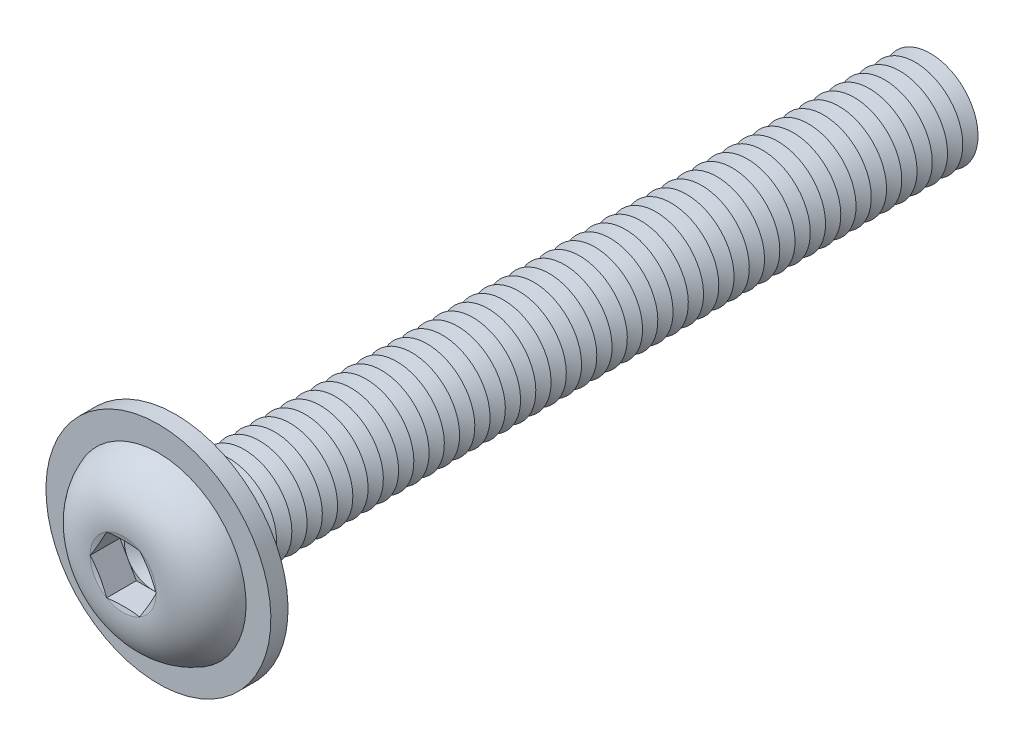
ISO-10303-21;
HEADER;
FILE_DESCRIPTION(('STEP AP214'),'2;1');
FILE_NAME('part.step','',(''),(''),'','','');
FILE_SCHEMA(('AUTOMOTIVE_DESIGN { 1 0 10303 214 1 1 1 1 }'));
ENDSEC;
DATA;
#1=APPLICATION_CONTEXT('core data for automotive mechanical design processes');
#2=APPLICATION_PROTOCOL_DEFINITION('international standard','automotive_design',2000,#1);
#3=PRODUCT_CONTEXT('',#1,'mechanical');
#4=PRODUCT('Part','Part','',(#3));
#5=PRODUCT_RELATED_PRODUCT_CATEGORY('part','',(#4));
#6=PRODUCT_DEFINITION_FORMATION('','',#4);
#7=PRODUCT_DEFINITION_CONTEXT('part definition',#1,'design');
#8=PRODUCT_DEFINITION('design','',#6,#7);
#9=PRODUCT_DEFINITION_SHAPE('','',#8);
#10=(LENGTH_UNIT() NAMED_UNIT(*) SI_UNIT(.MILLI.,.METRE.));
#11=(NAMED_UNIT(*) PLANE_ANGLE_UNIT() SI_UNIT($,.RADIAN.));
#12=(NAMED_UNIT(*) SI_UNIT($,.STERADIAN.) SOLID_ANGLE_UNIT());
#13=UNCERTAINTY_MEASURE_WITH_UNIT(LENGTH_MEASURE(1.E-05),#10,'distance_accuracy_value','');
#14=(GEOMETRIC_REPRESENTATION_CONTEXT(3) GLOBAL_UNCERTAINTY_ASSIGNED_CONTEXT((#13)) GLOBAL_UNIT_ASSIGNED_CONTEXT((#10,
#11,#12)) REPRESENTATION_CONTEXT('',''));
#15=CARTESIAN_POINT('',(0.,0.,0.));
#16=DIRECTION('',(0.,0.,1.));
#17=DIRECTION('',(1.,0.,0.));
#18=AXIS2_PLACEMENT_3D('',#15,#16,#17);
#19=CARTESIAN_POINT('',(0.,0.,-37.2));
#20=DIRECTION('',(0.,0.,1.));
#21=DIRECTION('',(0.,-1.,0.));
#22=AXIS2_PLACEMENT_3D('',#19,#20,#21);
#23=CONICAL_SURFACE('',#22,2.49999999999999,1.0471975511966);
#24=CARTESIAN_POINT('',(0.,0.,-37.6));
#25=DIRECTION('',(0.,0.,1.));
#26=DIRECTION('',(0.,-1.,0.));
#27=AXIS2_PLACEMENT_3D('',#24,#25,#26);
#28=CIRCLE('',#27,1.80717967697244);
#29=CARTESIAN_POINT('',(0.,-1.80717967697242,-37.6));
#30=VERTEX_POINT('',#29);
#31=EDGE_CURVE('E609',#30,#30,#28,.T.);
#32=ORIENTED_EDGE('',*,*,#31,.T.);
#33=EDGE_LOOP('',(#32));
#34=FACE_BOUND('',#33,.T.);
#35=CARTESIAN_POINT('',(0.,0.,-37.2));
#36=DIRECTION('',(0.,0.,1.));
#37=DIRECTION('',(0.,-1.,0.));
#38=AXIS2_PLACEMENT_3D('',#35,#36,#37);
#39=CIRCLE('',#38,2.49999999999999);
#40=CARTESIAN_POINT('',(0.,-2.49999999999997,-37.2));
#41=VERTEX_POINT('',#40);
#42=EDGE_CURVE('E605',#41,#41,#39,.T.);
#43=ORIENTED_EDGE('',*,*,#42,.F.);
#44=EDGE_LOOP('',(#43));
#45=FACE_BOUND('',#44,.T.);
#46=ADVANCED_FACE('F39',(#34,#45),#23,.T.);
#47=CARTESIAN_POINT('',(0.,0.,-37.6));
#48=DIRECTION('',(0.,0.,-1.));
#49=DIRECTION('',(0.,1.,0.));
#50=AXIS2_PLACEMENT_3D('',#47,#48,#49);
#51=CONICAL_SURFACE('',#50,1.80717967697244,1.04719755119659);
#52=CARTESIAN_POINT('',(0.,0.,-38.));
#53=DIRECTION('',(0.,0.,1.));
#54=DIRECTION('',(0.,-1.,0.));
#55=AXIS2_PLACEMENT_3D('',#52,#53,#54);
#56=CIRCLE('',#55,2.49999999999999);
#57=CARTESIAN_POINT('',(0.,-2.49999999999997,-38.));
#58=VERTEX_POINT('',#57);
#59=EDGE_CURVE('E613',#58,#58,#56,.T.);
#60=ORIENTED_EDGE('',*,*,#59,.T.);
#61=EDGE_LOOP('',(#60));
#62=FACE_BOUND('',#61,.T.);
#63=ORIENTED_EDGE('',*,*,#31,.F.);
#64=EDGE_LOOP('',(#63));
#65=FACE_BOUND('',#64,.T.);
#66=ADVANCED_FACE('F728',(#62,#65),#51,.T.);
#67=CARTESIAN_POINT('',(0.,2.5,-40.));
#68=DIRECTION('',(0.,0.,-1.));
#69=DIRECTION('',(0.,1.,0.));
#70=AXIS2_PLACEMENT_3D('',#67,#68,#69);
#71=PLANE('',#70);
#72=CARTESIAN_POINT('',(0.,0.,-40.));
#73=DIRECTION('',(0.,0.,1.));
#74=DIRECTION('',(0.,-1.,0.));
#75=AXIS2_PLACEMENT_3D('',#72,#73,#74);
#76=CIRCLE('',#75,1.80717967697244);
#77=CARTESIAN_POINT('',(0.,-1.80717967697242,-40.));
#78=VERTEX_POINT('',#77);
#79=EDGE_CURVE('E633',#78,#78,#76,.T.);
#80=ORIENTED_EDGE('',*,*,#79,.F.);
#81=EDGE_LOOP('',(#80));
#82=FACE_BOUND('',#81,.T.);
#83=ADVANCED_FACE('F734',(#82),#71,.T.);
#84=CARTESIAN_POINT('',(0.,0.,-39.6));
#85=DIRECTION('',(0.,0.,1.));
#86=DIRECTION('',(0.,-1.,0.));
#87=AXIS2_PLACEMENT_3D('',#84,#85,#86);
#88=CONICAL_SURFACE('',#87,2.49999999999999,1.0471975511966);
#89=ORIENTED_EDGE('',*,*,#79,.T.);
#90=EDGE_LOOP('',(#89));
#91=FACE_BOUND('',#90,.T.);
#92=CARTESIAN_POINT('',(0.,0.,-39.6));
#93=DIRECTION('',(0.,0.,1.));
#94=DIRECTION('',(0.,-1.,0.));
#95=AXIS2_PLACEMENT_3D('',#92,#93,#94);
#96=CIRCLE('',#95,2.49999999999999);
#97=CARTESIAN_POINT('',(0.,-2.49999999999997,-39.6));
#98=VERTEX_POINT('',#97);
#99=EDGE_CURVE('E629',#98,#98,#96,.T.);
#100=ORIENTED_EDGE('',*,*,#99,.F.);
#101=EDGE_LOOP('',(#100));
#102=FACE_BOUND('',#101,.T.);
#103=ADVANCED_FACE('F753',(#91,#102),#88,.T.);
#104=CARTESIAN_POINT('',(0.,0.,-39.2));
#105=DIRECTION('',(0.,0.,-1.));
#106=DIRECTION('',(0.,1.,0.));
#107=AXIS2_PLACEMENT_3D('',#104,#105,#106);
#108=CONICAL_SURFACE('',#107,1.80717967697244,1.04719755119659);
#109=ORIENTED_EDGE('',*,*,#99,.T.);
#110=EDGE_LOOP('',(#109));
#111=FACE_BOUND('',#110,.T.);
#112=CARTESIAN_POINT('',(0.,0.,-39.2));
#113=DIRECTION('',(0.,0.,1.));
#114=DIRECTION('',(0.,-1.,0.));
#115=AXIS2_PLACEMENT_3D('',#112,#113,#114);
#116=CIRCLE('',#115,1.80717967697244);
#117=CARTESIAN_POINT('',(0.,-1.80717967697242,-39.2));
#118=VERTEX_POINT('',#117);
#119=EDGE_CURVE('E625',#118,#118,#116,.T.);
#120=ORIENTED_EDGE('',*,*,#119,.F.);
#121=EDGE_LOOP('',(#120));
#122=FACE_BOUND('',#121,.T.);
#123=ADVANCED_FACE('F750',(#111,#122),#108,.T.);
#124=CARTESIAN_POINT('',(0.,0.,-38.8));
#125=DIRECTION('',(0.,0.,1.));
#126=DIRECTION('',(0.,-1.,0.));
#127=AXIS2_PLACEMENT_3D('',#124,#125,#126);
#128=CONICAL_SURFACE('',#127,2.49999999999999,1.0471975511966);
#129=ORIENTED_EDGE('',*,*,#119,.T.);
#130=EDGE_LOOP('',(#129));
#131=FACE_BOUND('',#130,.T.);
#132=CARTESIAN_POINT('',(0.,0.,-38.8));
#133=DIRECTION('',(0.,0.,1.));
#134=DIRECTION('',(0.,-1.,0.));
#135=AXIS2_PLACEMENT_3D('',#132,#133,#134);
#136=CIRCLE('',#135,2.49999999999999);
#137=CARTESIAN_POINT('',(0.,-2.49999999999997,-38.8));
#138=VERTEX_POINT('',#137);
#139=EDGE_CURVE('E621',#138,#138,#136,.T.);
#140=ORIENTED_EDGE('',*,*,#139,.F.);
#141=EDGE_LOOP('',(#140));
#142=FACE_BOUND('',#141,.T.);
#143=ADVANCED_FACE('F744',(#131,#142),#128,.T.);
#144=CARTESIAN_POINT('',(0.,0.,-38.4));
#145=DIRECTION('',(0.,0.,-1.));
#146=DIRECTION('',(0.,1.,0.));
#147=AXIS2_PLACEMENT_3D('',#144,#145,#146);
#148=CONICAL_SURFACE('',#147,1.80717967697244,1.04719755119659);
#149=ORIENTED_EDGE('',*,*,#139,.T.);
#150=EDGE_LOOP('',(#149));
#151=FACE_BOUND('',#150,.T.);
#152=CARTESIAN_POINT('',(0.,0.,-38.4));
#153=DIRECTION('',(0.,0.,1.));
#154=DIRECTION('',(0.,-1.,0.));
#155=AXIS2_PLACEMENT_3D('',#152,#153,#154);
#156=CIRCLE('',#155,1.80717967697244);
#157=CARTESIAN_POINT('',(0.,-1.80717967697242,-38.4));
#158=VERTEX_POINT('',#157);
#159=EDGE_CURVE('E617',#158,#158,#156,.T.);
#160=ORIENTED_EDGE('',*,*,#159,.F.);
#161=EDGE_LOOP('',(#160));
#162=FACE_BOUND('',#161,.T.);
#163=ADVANCED_FACE('F740',(#151,#162),#148,.T.);
#164=CARTESIAN_POINT('',(0.,0.,-38.));
#165=DIRECTION('',(0.,0.,1.));
#166=DIRECTION('',(0.,-1.,0.));
#167=AXIS2_PLACEMENT_3D('',#164,#165,#166);
#168=CONICAL_SURFACE('',#167,2.49999999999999,1.0471975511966);
#169=ORIENTED_EDGE('',*,*,#159,.T.);
#170=EDGE_LOOP('',(#169));
#171=FACE_BOUND('',#170,.T.);
#172=ORIENTED_EDGE('',*,*,#59,.F.);
#173=EDGE_LOOP('',(#172));
#174=FACE_BOUND('',#173,.T.);
#175=ADVANCED_FACE('F743',(#171,#174),#168,.T.);
#176=CARTESIAN_POINT('',(0.,0.,-36.4));
#177=DIRECTION('',(0.,0.,1.));
#178=DIRECTION('',(0.,-1.,0.));
#179=AXIS2_PLACEMENT_3D('',#176,#177,#178);
#180=CONICAL_SURFACE('',#179,2.49999999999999,1.0471975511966);
#181=CARTESIAN_POINT('',(0.,0.,-36.8));
#182=DIRECTION('',(0.,0.,1.));
#183=DIRECTION('',(0.,-1.,0.));
#184=AXIS2_PLACEMENT_3D('',#181,#182,#183);
#185=CIRCLE('',#184,1.80717967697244);
#186=CARTESIAN_POINT('',(0.,-1.80717967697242,-36.8));
#187=VERTEX_POINT('',#186);
#188=EDGE_CURVE('E601',#187,#187,#185,.T.);
#189=ORIENTED_EDGE('',*,*,#188,.T.);
#190=EDGE_LOOP('',(#189));
#191=FACE_BOUND('',#190,.T.);
#192=CARTESIAN_POINT('',(0.,0.,-36.4));
#193=DIRECTION('',(0.,0.,1.));
#194=DIRECTION('',(0.,-1.,0.));
#195=AXIS2_PLACEMENT_3D('',#192,#193,#194);
#196=CIRCLE('',#195,2.49999999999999);
#197=CARTESIAN_POINT('',(0.,-2.49999999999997,-36.4));
#198=VERTEX_POINT('',#197);
#199=EDGE_CURVE('E597',#198,#198,#196,.T.);
#200=ORIENTED_EDGE('',*,*,#199,.F.);
#201=EDGE_LOOP('',(#200));
#202=FACE_BOUND('',#201,.T.);
#203=ADVANCED_FACE('F748',(#191,#202),#180,.T.);
#204=CARTESIAN_POINT('',(0.,0.,-36.8));
#205=DIRECTION('',(0.,0.,-1.));
#206=DIRECTION('',(0.,1.,0.));
#207=AXIS2_PLACEMENT_3D('',#204,#205,#206);
#208=CONICAL_SURFACE('',#207,1.80717967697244,1.04719755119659);
#209=ORIENTED_EDGE('',*,*,#42,.T.);
#210=EDGE_LOOP('',(#209));
#211=FACE_BOUND('',#210,.T.);
#212=ORIENTED_EDGE('',*,*,#188,.F.);
#213=EDGE_LOOP('',(#212));
#214=FACE_BOUND('',#213,.T.);
#215=ADVANCED_FACE('F799',(#211,#214),#208,.T.);
#216=CARTESIAN_POINT('',(0.,0.,-35.6));
#217=DIRECTION('',(0.,0.,1.));
#218=DIRECTION('',(0.,-1.,0.));
#219=AXIS2_PLACEMENT_3D('',#216,#217,#218);
#220=CONICAL_SURFACE('',#219,2.49999999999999,1.0471975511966);
#221=CARTESIAN_POINT('',(0.,0.,-36.));
#222=DIRECTION('',(0.,0.,1.));
#223=DIRECTION('',(0.,-1.,0.));
#224=AXIS2_PLACEMENT_3D('',#221,#222,#223);
#225=CIRCLE('',#224,1.80717967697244);
#226=CARTESIAN_POINT('',(0.,-1.80717967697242,-36.));
#227=VERTEX_POINT('',#226);
#228=EDGE_CURVE('E593',#227,#227,#225,.T.);
#229=ORIENTED_EDGE('',*,*,#228,.T.);
#230=EDGE_LOOP('',(#229));
#231=FACE_BOUND('',#230,.T.);
#232=CARTESIAN_POINT('',(0.,0.,-35.6));
#233=DIRECTION('',(0.,0.,1.));
#234=DIRECTION('',(0.,-1.,0.));
#235=AXIS2_PLACEMENT_3D('',#232,#233,#234);
#236=CIRCLE('',#235,2.49999999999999);
#237=CARTESIAN_POINT('',(0.,-2.49999999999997,-35.6));
#238=VERTEX_POINT('',#237);
#239=EDGE_CURVE('E589',#238,#238,#236,.T.);
#240=ORIENTED_EDGE('',*,*,#239,.F.);
#241=EDGE_LOOP('',(#240));
#242=FACE_BOUND('',#241,.T.);
#243=ADVANCED_FACE('F805',(#231,#242),#220,.T.);
#244=CARTESIAN_POINT('',(0.,0.,-36.));
#245=DIRECTION('',(0.,0.,-1.));
#246=DIRECTION('',(0.,1.,0.));
#247=AXIS2_PLACEMENT_3D('',#244,#245,#246);
#248=CONICAL_SURFACE('',#247,1.80717967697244,1.04719755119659);
#249=ORIENTED_EDGE('',*,*,#199,.T.);
#250=EDGE_LOOP('',(#249));
#251=FACE_BOUND('',#250,.T.);
#252=ORIENTED_EDGE('',*,*,#228,.F.);
#253=EDGE_LOOP('',(#252));
#254=FACE_BOUND('',#253,.T.);
#255=ADVANCED_FACE('F812',(#251,#254),#248,.T.);
#256=CARTESIAN_POINT('',(0.,0.,-34.8));
#257=DIRECTION('',(0.,0.,1.));
#258=DIRECTION('',(0.,-1.,0.));
#259=AXIS2_PLACEMENT_3D('',#256,#257,#258);
#260=CONICAL_SURFACE('',#259,2.49999999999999,1.0471975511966);
#261=CARTESIAN_POINT('',(0.,0.,-35.2));
#262=DIRECTION('',(0.,0.,1.));
#263=DIRECTION('',(0.,-1.,0.));
#264=AXIS2_PLACEMENT_3D('',#261,#262,#263);
#265=CIRCLE('',#264,1.80717967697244);
#266=CARTESIAN_POINT('',(0.,-1.80717967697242,-35.2));
#267=VERTEX_POINT('',#266);
#268=EDGE_CURVE('E585',#267,#267,#265,.T.);
#269=ORIENTED_EDGE('',*,*,#268,.T.);
#270=EDGE_LOOP('',(#269));
#271=FACE_BOUND('',#270,.T.);
#272=CARTESIAN_POINT('',(0.,0.,-34.8));
#273=DIRECTION('',(0.,0.,1.));
#274=DIRECTION('',(0.,-1.,0.));
#275=AXIS2_PLACEMENT_3D('',#272,#273,#274);
#276=CIRCLE('',#275,2.49999999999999);
#277=CARTESIAN_POINT('',(0.,-2.49999999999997,-34.8));
#278=VERTEX_POINT('',#277);
#279=EDGE_CURVE('E581',#278,#278,#276,.T.);
#280=ORIENTED_EDGE('',*,*,#279,.F.);
#281=EDGE_LOOP('',(#280));
#282=FACE_BOUND('',#281,.T.);
#283=ADVANCED_FACE('F819',(#271,#282),#260,.T.);
#284=CARTESIAN_POINT('',(0.,0.,-35.2));
#285=DIRECTION('',(0.,0.,-1.));
#286=DIRECTION('',(0.,1.,0.));
#287=AXIS2_PLACEMENT_3D('',#284,#285,#286);
#288=CONICAL_SURFACE('',#287,1.80717967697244,1.04719755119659);
#289=ORIENTED_EDGE('',*,*,#239,.T.);
#290=EDGE_LOOP('',(#289));
#291=FACE_BOUND('',#290,.T.);
#292=ORIENTED_EDGE('',*,*,#268,.F.);
#293=EDGE_LOOP('',(#292));
#294=FACE_BOUND('',#293,.T.);
#295=ADVANCED_FACE('F826',(#291,#294),#288,.T.);
#296=CARTESIAN_POINT('',(0.,0.,-34.));
#297=DIRECTION('',(0.,0.,1.));
#298=DIRECTION('',(0.,-1.,0.));
#299=AXIS2_PLACEMENT_3D('',#296,#297,#298);
#300=CONICAL_SURFACE('',#299,2.49999999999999,1.0471975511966);
#301=CARTESIAN_POINT('',(0.,0.,-34.4));
#302=DIRECTION('',(0.,0.,1.));
#303=DIRECTION('',(0.,-1.,0.));
#304=AXIS2_PLACEMENT_3D('',#301,#302,#303);
#305=CIRCLE('',#304,1.80717967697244);
#306=CARTESIAN_POINT('',(0.,-1.80717967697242,-34.4));
#307=VERTEX_POINT('',#306);
#308=EDGE_CURVE('E577',#307,#307,#305,.T.);
#309=ORIENTED_EDGE('',*,*,#308,.T.);
#310=EDGE_LOOP('',(#309));
#311=FACE_BOUND('',#310,.T.);
#312=CARTESIAN_POINT('',(0.,0.,-34.));
#313=DIRECTION('',(0.,0.,1.));
#314=DIRECTION('',(0.,-1.,0.));
#315=AXIS2_PLACEMENT_3D('',#312,#313,#314);
#316=CIRCLE('',#315,2.49999999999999);
#317=CARTESIAN_POINT('',(0.,-2.49999999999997,-34.));
#318=VERTEX_POINT('',#317);
#319=EDGE_CURVE('E573',#318,#318,#316,.T.);
#320=ORIENTED_EDGE('',*,*,#319,.F.);
#321=EDGE_LOOP('',(#320));
#322=FACE_BOUND('',#321,.T.);
#323=ADVANCED_FACE('F833',(#311,#322),#300,.T.);
#324=CARTESIAN_POINT('',(0.,0.,-34.4));
#325=DIRECTION('',(0.,0.,-1.));
#326=DIRECTION('',(0.,1.,0.));
#327=AXIS2_PLACEMENT_3D('',#324,#325,#326);
#328=CONICAL_SURFACE('',#327,1.80717967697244,1.04719755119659);
#329=ORIENTED_EDGE('',*,*,#279,.T.);
#330=EDGE_LOOP('',(#329));
#331=FACE_BOUND('',#330,.T.);
#332=ORIENTED_EDGE('',*,*,#308,.F.);
#333=EDGE_LOOP('',(#332));
#334=FACE_BOUND('',#333,.T.);
#335=ADVANCED_FACE('F840',(#331,#334),#328,.T.);
#336=CARTESIAN_POINT('',(0.,0.,-33.2));
#337=DIRECTION('',(0.,0.,1.));
#338=DIRECTION('',(0.,-1.,0.));
#339=AXIS2_PLACEMENT_3D('',#336,#337,#338);
#340=CONICAL_SURFACE('',#339,2.49999999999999,1.0471975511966);
#341=CARTESIAN_POINT('',(0.,0.,-33.6));
#342=DIRECTION('',(0.,0.,1.));
#343=DIRECTION('',(0.,-1.,0.));
#344=AXIS2_PLACEMENT_3D('',#341,#342,#343);
#345=CIRCLE('',#344,1.80717967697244);
#346=CARTESIAN_POINT('',(0.,-1.80717967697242,-33.6));
#347=VERTEX_POINT('',#346);
#348=EDGE_CURVE('E569',#347,#347,#345,.T.);
#349=ORIENTED_EDGE('',*,*,#348,.T.);
#350=EDGE_LOOP('',(#349));
#351=FACE_BOUND('',#350,.T.);
#352=CARTESIAN_POINT('',(0.,0.,-33.2));
#353=DIRECTION('',(0.,0.,1.));
#354=DIRECTION('',(0.,-1.,0.));
#355=AXIS2_PLACEMENT_3D('',#352,#353,#354);
#356=CIRCLE('',#355,2.49999999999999);
#357=CARTESIAN_POINT('',(0.,-2.49999999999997,-33.2));
#358=VERTEX_POINT('',#357);
#359=EDGE_CURVE('E565',#358,#358,#356,.T.);
#360=ORIENTED_EDGE('',*,*,#359,.F.);
#361=EDGE_LOOP('',(#360));
#362=FACE_BOUND('',#361,.T.);
#363=ADVANCED_FACE('F847',(#351,#362),#340,.T.);
#364=CARTESIAN_POINT('',(0.,0.,-33.6));
#365=DIRECTION('',(0.,0.,-1.));
#366=DIRECTION('',(0.,1.,0.));
#367=AXIS2_PLACEMENT_3D('',#364,#365,#366);
#368=CONICAL_SURFACE('',#367,1.80717967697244,1.04719755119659);
#369=ORIENTED_EDGE('',*,*,#319,.T.);
#370=EDGE_LOOP('',(#369));
#371=FACE_BOUND('',#370,.T.);
#372=ORIENTED_EDGE('',*,*,#348,.F.);
#373=EDGE_LOOP('',(#372));
#374=FACE_BOUND('',#373,.T.);
#375=ADVANCED_FACE('F854',(#371,#374),#368,.T.);
#376=CARTESIAN_POINT('',(0.,0.,-32.4));
#377=DIRECTION('',(0.,0.,1.));
#378=DIRECTION('',(0.,-1.,0.));
#379=AXIS2_PLACEMENT_3D('',#376,#377,#378);
#380=CONICAL_SURFACE('',#379,2.49999999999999,1.0471975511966);
#381=CARTESIAN_POINT('',(0.,0.,-32.8));
#382=DIRECTION('',(0.,0.,1.));
#383=DIRECTION('',(0.,-1.,0.));
#384=AXIS2_PLACEMENT_3D('',#381,#382,#383);
#385=CIRCLE('',#384,1.80717967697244);
#386=CARTESIAN_POINT('',(0.,-1.80717967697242,-32.8));
#387=VERTEX_POINT('',#386);
#388=EDGE_CURVE('E561',#387,#387,#385,.T.);
#389=ORIENTED_EDGE('',*,*,#388,.T.);
#390=EDGE_LOOP('',(#389));
#391=FACE_BOUND('',#390,.T.);
#392=CARTESIAN_POINT('',(0.,0.,-32.4));
#393=DIRECTION('',(0.,0.,1.));
#394=DIRECTION('',(0.,-1.,0.));
#395=AXIS2_PLACEMENT_3D('',#392,#393,#394);
#396=CIRCLE('',#395,2.49999999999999);
#397=CARTESIAN_POINT('',(0.,-2.49999999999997,-32.4));
#398=VERTEX_POINT('',#397);
#399=EDGE_CURVE('E557',#398,#398,#396,.T.);
#400=ORIENTED_EDGE('',*,*,#399,.F.);
#401=EDGE_LOOP('',(#400));
#402=FACE_BOUND('',#401,.T.);
#403=ADVANCED_FACE('F861',(#391,#402),#380,.T.);
#404=CARTESIAN_POINT('',(0.,0.,-32.8));
#405=DIRECTION('',(0.,0.,-1.));
#406=DIRECTION('',(0.,1.,0.));
#407=AXIS2_PLACEMENT_3D('',#404,#405,#406);
#408=CONICAL_SURFACE('',#407,1.80717967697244,1.04719755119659);
#409=ORIENTED_EDGE('',*,*,#359,.T.);
#410=EDGE_LOOP('',(#409));
#411=FACE_BOUND('',#410,.T.);
#412=ORIENTED_EDGE('',*,*,#388,.F.);
#413=EDGE_LOOP('',(#412));
#414=FACE_BOUND('',#413,.T.);
#415=ADVANCED_FACE('F868',(#411,#414),#408,.T.);
#416=CARTESIAN_POINT('',(0.,0.,-31.6));
#417=DIRECTION('',(0.,0.,1.));
#418=DIRECTION('',(0.,-1.,0.));
#419=AXIS2_PLACEMENT_3D('',#416,#417,#418);
#420=CONICAL_SURFACE('',#419,2.49999999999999,1.0471975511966);
#421=CARTESIAN_POINT('',(0.,0.,-32.));
#422=DIRECTION('',(0.,0.,1.));
#423=DIRECTION('',(0.,-1.,0.));
#424=AXIS2_PLACEMENT_3D('',#421,#422,#423);
#425=CIRCLE('',#424,1.80717967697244);
#426=CARTESIAN_POINT('',(0.,-1.80717967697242,-32.));
#427=VERTEX_POINT('',#426);
#428=EDGE_CURVE('E553',#427,#427,#425,.T.);
#429=ORIENTED_EDGE('',*,*,#428,.T.);
#430=EDGE_LOOP('',(#429));
#431=FACE_BOUND('',#430,.T.);
#432=CARTESIAN_POINT('',(0.,0.,-31.6));
#433=DIRECTION('',(0.,0.,1.));
#434=DIRECTION('',(0.,-1.,0.));
#435=AXIS2_PLACEMENT_3D('',#432,#433,#434);
#436=CIRCLE('',#435,2.49999999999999);
#437=CARTESIAN_POINT('',(0.,-2.49999999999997,-31.6));
#438=VERTEX_POINT('',#437);
#439=EDGE_CURVE('E549',#438,#438,#436,.T.);
#440=ORIENTED_EDGE('',*,*,#439,.F.);
#441=EDGE_LOOP('',(#440));
#442=FACE_BOUND('',#441,.T.);
#443=ADVANCED_FACE('F875',(#431,#442),#420,.T.);
#444=CARTESIAN_POINT('',(0.,0.,-32.));
#445=DIRECTION('',(0.,0.,-1.));
#446=DIRECTION('',(0.,1.,0.));
#447=AXIS2_PLACEMENT_3D('',#444,#445,#446);
#448=CONICAL_SURFACE('',#447,1.80717967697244,1.04719755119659);
#449=ORIENTED_EDGE('',*,*,#399,.T.);
#450=EDGE_LOOP('',(#449));
#451=FACE_BOUND('',#450,.T.);
#452=ORIENTED_EDGE('',*,*,#428,.F.);
#453=EDGE_LOOP('',(#452));
#454=FACE_BOUND('',#453,.T.);
#455=ADVANCED_FACE('F882',(#451,#454),#448,.T.);
#456=CARTESIAN_POINT('',(0.,0.,-30.8));
#457=DIRECTION('',(0.,0.,1.));
#458=DIRECTION('',(0.,-1.,0.));
#459=AXIS2_PLACEMENT_3D('',#456,#457,#458);
#460=CONICAL_SURFACE('',#459,2.49999999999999,1.0471975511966);
#461=CARTESIAN_POINT('',(0.,0.,-31.2));
#462=DIRECTION('',(0.,0.,1.));
#463=DIRECTION('',(0.,-1.,0.));
#464=AXIS2_PLACEMENT_3D('',#461,#462,#463);
#465=CIRCLE('',#464,1.80717967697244);
#466=CARTESIAN_POINT('',(0.,-1.80717967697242,-31.2));
#467=VERTEX_POINT('',#466);
#468=EDGE_CURVE('E545',#467,#467,#465,.T.);
#469=ORIENTED_EDGE('',*,*,#468,.T.);
#470=EDGE_LOOP('',(#469));
#471=FACE_BOUND('',#470,.T.);
#472=CARTESIAN_POINT('',(0.,0.,-30.8));
#473=DIRECTION('',(0.,0.,1.));
#474=DIRECTION('',(0.,-1.,0.));
#475=AXIS2_PLACEMENT_3D('',#472,#473,#474);
#476=CIRCLE('',#475,2.49999999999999);
#477=CARTESIAN_POINT('',(0.,-2.49999999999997,-30.8));
#478=VERTEX_POINT('',#477);
#479=EDGE_CURVE('E541',#478,#478,#476,.T.);
#480=ORIENTED_EDGE('',*,*,#479,.F.);
#481=EDGE_LOOP('',(#480));
#482=FACE_BOUND('',#481,.T.);
#483=ADVANCED_FACE('F889',(#471,#482),#460,.T.);
#484=CARTESIAN_POINT('',(0.,0.,-31.2));
#485=DIRECTION('',(0.,0.,-1.));
#486=DIRECTION('',(0.,1.,0.));
#487=AXIS2_PLACEMENT_3D('',#484,#485,#486);
#488=CONICAL_SURFACE('',#487,1.80717967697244,1.04719755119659);
#489=ORIENTED_EDGE('',*,*,#439,.T.);
#490=EDGE_LOOP('',(#489));
#491=FACE_BOUND('',#490,.T.);
#492=ORIENTED_EDGE('',*,*,#468,.F.);
#493=EDGE_LOOP('',(#492));
#494=FACE_BOUND('',#493,.T.);
#495=ADVANCED_FACE('F896',(#491,#494),#488,.T.);
#496=CARTESIAN_POINT('',(0.,0.,-30.));
#497=DIRECTION('',(0.,0.,1.));
#498=DIRECTION('',(0.,-1.,0.));
#499=AXIS2_PLACEMENT_3D('',#496,#497,#498);
#500=CONICAL_SURFACE('',#499,2.49999999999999,1.0471975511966);
#501=CARTESIAN_POINT('',(0.,0.,-30.4));
#502=DIRECTION('',(0.,0.,1.));
#503=DIRECTION('',(0.,-1.,0.));
#504=AXIS2_PLACEMENT_3D('',#501,#502,#503);
#505=CIRCLE('',#504,1.80717967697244);
#506=CARTESIAN_POINT('',(0.,-1.80717967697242,-30.4));
#507=VERTEX_POINT('',#506);
#508=EDGE_CURVE('E537',#507,#507,#505,.T.);
#509=ORIENTED_EDGE('',*,*,#508,.T.);
#510=EDGE_LOOP('',(#509));
#511=FACE_BOUND('',#510,.T.);
#512=CARTESIAN_POINT('',(0.,0.,-30.));
#513=DIRECTION('',(0.,0.,1.));
#514=DIRECTION('',(0.,-1.,0.));
#515=AXIS2_PLACEMENT_3D('',#512,#513,#514);
#516=CIRCLE('',#515,2.49999999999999);
#517=CARTESIAN_POINT('',(0.,-2.49999999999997,-30.));
#518=VERTEX_POINT('',#517);
#519=EDGE_CURVE('E533',#518,#518,#516,.T.);
#520=ORIENTED_EDGE('',*,*,#519,.F.);
#521=EDGE_LOOP('',(#520));
#522=FACE_BOUND('',#521,.T.);
#523=ADVANCED_FACE('F903',(#511,#522),#500,.T.);
#524=CARTESIAN_POINT('',(0.,0.,-30.4));
#525=DIRECTION('',(0.,0.,-1.));
#526=DIRECTION('',(0.,1.,0.));
#527=AXIS2_PLACEMENT_3D('',#524,#525,#526);
#528=CONICAL_SURFACE('',#527,1.80717967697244,1.04719755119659);
#529=ORIENTED_EDGE('',*,*,#479,.T.);
#530=EDGE_LOOP('',(#529));
#531=FACE_BOUND('',#530,.T.);
#532=ORIENTED_EDGE('',*,*,#508,.F.);
#533=EDGE_LOOP('',(#532));
#534=FACE_BOUND('',#533,.T.);
#535=ADVANCED_FACE('F910',(#531,#534),#528,.T.);
#536=CARTESIAN_POINT('',(0.,0.,-29.2));
#537=DIRECTION('',(0.,0.,1.));
#538=DIRECTION('',(0.,-1.,0.));
#539=AXIS2_PLACEMENT_3D('',#536,#537,#538);
#540=CONICAL_SURFACE('',#539,2.49999999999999,1.0471975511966);
#541=CARTESIAN_POINT('',(0.,0.,-29.6));
#542=DIRECTION('',(0.,0.,1.));
#543=DIRECTION('',(0.,-1.,0.));
#544=AXIS2_PLACEMENT_3D('',#541,#542,#543);
#545=CIRCLE('',#544,1.80717967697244);
#546=CARTESIAN_POINT('',(0.,-1.80717967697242,-29.6));
#547=VERTEX_POINT('',#546);
#548=EDGE_CURVE('E529',#547,#547,#545,.T.);
#549=ORIENTED_EDGE('',*,*,#548,.T.);
#550=EDGE_LOOP('',(#549));
#551=FACE_BOUND('',#550,.T.);
#552=CARTESIAN_POINT('',(0.,0.,-29.2));
#553=DIRECTION('',(0.,0.,1.));
#554=DIRECTION('',(0.,-1.,0.));
#555=AXIS2_PLACEMENT_3D('',#552,#553,#554);
#556=CIRCLE('',#555,2.49999999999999);
#557=CARTESIAN_POINT('',(0.,-2.49999999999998,-29.2));
#558=VERTEX_POINT('',#557);
#559=EDGE_CURVE('E525',#558,#558,#556,.T.);
#560=ORIENTED_EDGE('',*,*,#559,.F.);
#561=EDGE_LOOP('',(#560));
#562=FACE_BOUND('',#561,.T.);
#563=ADVANCED_FACE('F917',(#551,#562),#540,.T.);
#564=CARTESIAN_POINT('',(0.,0.,-29.6));
#565=DIRECTION('',(0.,0.,-1.));
#566=DIRECTION('',(0.,1.,0.));
#567=AXIS2_PLACEMENT_3D('',#564,#565,#566);
#568=CONICAL_SURFACE('',#567,1.80717967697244,1.04719755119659);
#569=ORIENTED_EDGE('',*,*,#519,.T.);
#570=EDGE_LOOP('',(#569));
#571=FACE_BOUND('',#570,.T.);
#572=ORIENTED_EDGE('',*,*,#548,.F.);
#573=EDGE_LOOP('',(#572));
#574=FACE_BOUND('',#573,.T.);
#575=ADVANCED_FACE('F924',(#571,#574),#568,.T.);
#576=CARTESIAN_POINT('',(0.,0.,-28.4));
#577=DIRECTION('',(0.,0.,1.));
#578=DIRECTION('',(0.,-1.,0.));
#579=AXIS2_PLACEMENT_3D('',#576,#577,#578);
#580=CONICAL_SURFACE('',#579,2.49999999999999,1.0471975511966);
#581=CARTESIAN_POINT('',(0.,0.,-28.8));
#582=DIRECTION('',(0.,0.,1.));
#583=DIRECTION('',(0.,-1.,0.));
#584=AXIS2_PLACEMENT_3D('',#581,#582,#583);
#585=CIRCLE('',#584,1.80717967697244);
#586=CARTESIAN_POINT('',(0.,-1.80717967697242,-28.8));
#587=VERTEX_POINT('',#586);
#588=EDGE_CURVE('E521',#587,#587,#585,.T.);
#589=ORIENTED_EDGE('',*,*,#588,.T.);
#590=EDGE_LOOP('',(#589));
#591=FACE_BOUND('',#590,.T.);
#592=CARTESIAN_POINT('',(0.,0.,-28.4));
#593=DIRECTION('',(0.,0.,1.));
#594=DIRECTION('',(0.,-1.,0.));
#595=AXIS2_PLACEMENT_3D('',#592,#593,#594);
#596=CIRCLE('',#595,2.49999999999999);
#597=CARTESIAN_POINT('',(0.,-2.49999999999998,-28.4));
#598=VERTEX_POINT('',#597);
#599=EDGE_CURVE('E517',#598,#598,#596,.T.);
#600=ORIENTED_EDGE('',*,*,#599,.F.);
#601=EDGE_LOOP('',(#600));
#602=FACE_BOUND('',#601,.T.);
#603=ADVANCED_FACE('F931',(#591,#602),#580,.T.);
#604=CARTESIAN_POINT('',(0.,0.,-28.8));
#605=DIRECTION('',(0.,0.,-1.));
#606=DIRECTION('',(0.,1.,0.));
#607=AXIS2_PLACEMENT_3D('',#604,#605,#606);
#608=CONICAL_SURFACE('',#607,1.80717967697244,1.04719755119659);
#609=ORIENTED_EDGE('',*,*,#559,.T.);
#610=EDGE_LOOP('',(#609));
#611=FACE_BOUND('',#610,.T.);
#612=ORIENTED_EDGE('',*,*,#588,.F.);
#613=EDGE_LOOP('',(#612));
#614=FACE_BOUND('',#613,.T.);
#615=ADVANCED_FACE('F938',(#611,#614),#608,.T.);
#616=CARTESIAN_POINT('',(0.,0.,-27.6));
#617=DIRECTION('',(0.,0.,1.));
#618=DIRECTION('',(0.,-1.,0.));
#619=AXIS2_PLACEMENT_3D('',#616,#617,#618);
#620=CONICAL_SURFACE('',#619,2.49999999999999,1.0471975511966);
#621=CARTESIAN_POINT('',(0.,0.,-28.));
#622=DIRECTION('',(0.,0.,1.));
#623=DIRECTION('',(0.,-1.,0.));
#624=AXIS2_PLACEMENT_3D('',#621,#622,#623);
#625=CIRCLE('',#624,1.80717967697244);
#626=CARTESIAN_POINT('',(0.,-1.80717967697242,-28.));
#627=VERTEX_POINT('',#626);
#628=EDGE_CURVE('E513',#627,#627,#625,.T.);
#629=ORIENTED_EDGE('',*,*,#628,.T.);
#630=EDGE_LOOP('',(#629));
#631=FACE_BOUND('',#630,.T.);
#632=CARTESIAN_POINT('',(0.,0.,-27.6));
#633=DIRECTION('',(0.,0.,1.));
#634=DIRECTION('',(0.,-1.,0.));
#635=AXIS2_PLACEMENT_3D('',#632,#633,#634);
#636=CIRCLE('',#635,2.49999999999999);
#637=CARTESIAN_POINT('',(0.,-2.49999999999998,-27.6));
#638=VERTEX_POINT('',#637);
#639=EDGE_CURVE('E509',#638,#638,#636,.T.);
#640=ORIENTED_EDGE('',*,*,#639,.F.);
#641=EDGE_LOOP('',(#640));
#642=FACE_BOUND('',#641,.T.);
#643=ADVANCED_FACE('F945',(#631,#642),#620,.T.);
#644=CARTESIAN_POINT('',(0.,0.,-28.));
#645=DIRECTION('',(0.,0.,-1.));
#646=DIRECTION('',(0.,1.,0.));
#647=AXIS2_PLACEMENT_3D('',#644,#645,#646);
#648=CONICAL_SURFACE('',#647,1.80717967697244,1.04719755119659);
#649=ORIENTED_EDGE('',*,*,#599,.T.);
#650=EDGE_LOOP('',(#649));
#651=FACE_BOUND('',#650,.T.);
#652=ORIENTED_EDGE('',*,*,#628,.F.);
#653=EDGE_LOOP('',(#652));
#654=FACE_BOUND('',#653,.T.);
#655=ADVANCED_FACE('F952',(#651,#654),#648,.T.);
#656=CARTESIAN_POINT('',(0.,0.,-26.8));
#657=DIRECTION('',(0.,0.,1.));
#658=DIRECTION('',(0.,-1.,0.));
#659=AXIS2_PLACEMENT_3D('',#656,#657,#658);
#660=CONICAL_SURFACE('',#659,2.49999999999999,1.0471975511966);
#661=CARTESIAN_POINT('',(0.,0.,-27.2));
#662=DIRECTION('',(0.,0.,1.));
#663=DIRECTION('',(0.,-1.,0.));
#664=AXIS2_PLACEMENT_3D('',#661,#662,#663);
#665=CIRCLE('',#664,1.80717967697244);
#666=CARTESIAN_POINT('',(0.,-1.80717967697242,-27.2));
#667=VERTEX_POINT('',#666);
#668=EDGE_CURVE('E505',#667,#667,#665,.T.);
#669=ORIENTED_EDGE('',*,*,#668,.T.);
#670=EDGE_LOOP('',(#669));
#671=FACE_BOUND('',#670,.T.);
#672=CARTESIAN_POINT('',(0.,0.,-26.8));
#673=DIRECTION('',(0.,0.,1.));
#674=DIRECTION('',(0.,-1.,0.));
#675=AXIS2_PLACEMENT_3D('',#672,#673,#674);
#676=CIRCLE('',#675,2.49999999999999);
#677=CARTESIAN_POINT('',(0.,-2.49999999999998,-26.8));
#678=VERTEX_POINT('',#677);
#679=EDGE_CURVE('E501',#678,#678,#676,.T.);
#680=ORIENTED_EDGE('',*,*,#679,.F.);
#681=EDGE_LOOP('',(#680));
#682=FACE_BOUND('',#681,.T.);
#683=ADVANCED_FACE('F959',(#671,#682),#660,.T.);
#684=CARTESIAN_POINT('',(0.,0.,-27.2));
#685=DIRECTION('',(0.,0.,-1.));
#686=DIRECTION('',(0.,1.,0.));
#687=AXIS2_PLACEMENT_3D('',#684,#685,#686);
#688=CONICAL_SURFACE('',#687,1.80717967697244,1.04719755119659);
#689=ORIENTED_EDGE('',*,*,#639,.T.);
#690=EDGE_LOOP('',(#689));
#691=FACE_BOUND('',#690,.T.);
#692=ORIENTED_EDGE('',*,*,#668,.F.);
#693=EDGE_LOOP('',(#692));
#694=FACE_BOUND('',#693,.T.);
#695=ADVANCED_FACE('F966',(#691,#694),#688,.T.);
#696=CARTESIAN_POINT('',(0.,0.,-26.));
#697=DIRECTION('',(0.,0.,1.));
#698=DIRECTION('',(0.,-1.,0.));
#699=AXIS2_PLACEMENT_3D('',#696,#697,#698);
#700=CONICAL_SURFACE('',#699,2.49999999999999,1.0471975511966);
#701=CARTESIAN_POINT('',(0.,0.,-26.4));
#702=DIRECTION('',(0.,0.,1.));
#703=DIRECTION('',(0.,-1.,0.));
#704=AXIS2_PLACEMENT_3D('',#701,#702,#703);
#705=CIRCLE('',#704,1.80717967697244);
#706=CARTESIAN_POINT('',(0.,-1.80717967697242,-26.4));
#707=VERTEX_POINT('',#706);
#708=EDGE_CURVE('E497',#707,#707,#705,.T.);
#709=ORIENTED_EDGE('',*,*,#708,.T.);
#710=EDGE_LOOP('',(#709));
#711=FACE_BOUND('',#710,.T.);
#712=CARTESIAN_POINT('',(0.,0.,-26.));
#713=DIRECTION('',(0.,0.,1.));
#714=DIRECTION('',(0.,-1.,0.));
#715=AXIS2_PLACEMENT_3D('',#712,#713,#714);
#716=CIRCLE('',#715,2.49999999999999);
#717=CARTESIAN_POINT('',(0.,-2.49999999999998,-26.));
#718=VERTEX_POINT('',#717);
#719=EDGE_CURVE('E493',#718,#718,#716,.T.);
#720=ORIENTED_EDGE('',*,*,#719,.F.);
#721=EDGE_LOOP('',(#720));
#722=FACE_BOUND('',#721,.T.);
#723=ADVANCED_FACE('F973',(#711,#722),#700,.T.);
#724=CARTESIAN_POINT('',(0.,0.,-26.4));
#725=DIRECTION('',(0.,0.,-1.));
#726=DIRECTION('',(0.,1.,0.));
#727=AXIS2_PLACEMENT_3D('',#724,#725,#726);
#728=CONICAL_SURFACE('',#727,1.80717967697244,1.04719755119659);
#729=ORIENTED_EDGE('',*,*,#679,.T.);
#730=EDGE_LOOP('',(#729));
#731=FACE_BOUND('',#730,.T.);
#732=ORIENTED_EDGE('',*,*,#708,.F.);
#733=EDGE_LOOP('',(#732));
#734=FACE_BOUND('',#733,.T.);
#735=ADVANCED_FACE('F980',(#731,#734),#728,.T.);
#736=CARTESIAN_POINT('',(0.,0.,-25.2));
#737=DIRECTION('',(0.,0.,1.));
#738=DIRECTION('',(0.,-1.,0.));
#739=AXIS2_PLACEMENT_3D('',#736,#737,#738);
#740=CONICAL_SURFACE('',#739,2.49999999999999,1.0471975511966);
#741=CARTESIAN_POINT('',(0.,0.,-25.6));
#742=DIRECTION('',(0.,0.,1.));
#743=DIRECTION('',(0.,-1.,0.));
#744=AXIS2_PLACEMENT_3D('',#741,#742,#743);
#745=CIRCLE('',#744,1.80717967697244);
#746=CARTESIAN_POINT('',(0.,-1.80717967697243,-25.6));
#747=VERTEX_POINT('',#746);
#748=EDGE_CURVE('E489',#747,#747,#745,.T.);
#749=ORIENTED_EDGE('',*,*,#748,.T.);
#750=EDGE_LOOP('',(#749));
#751=FACE_BOUND('',#750,.T.);
#752=CARTESIAN_POINT('',(0.,0.,-25.2));
#753=DIRECTION('',(0.,0.,1.));
#754=DIRECTION('',(0.,-1.,0.));
#755=AXIS2_PLACEMENT_3D('',#752,#753,#754);
#756=CIRCLE('',#755,2.49999999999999);
#757=CARTESIAN_POINT('',(0.,-2.49999999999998,-25.2));
#758=VERTEX_POINT('',#757);
#759=EDGE_CURVE('E485',#758,#758,#756,.T.);
#760=ORIENTED_EDGE('',*,*,#759,.F.);
#761=EDGE_LOOP('',(#760));
#762=FACE_BOUND('',#761,.T.);
#763=ADVANCED_FACE('F987',(#751,#762),#740,.T.);
#764=CARTESIAN_POINT('',(0.,0.,-25.6));
#765=DIRECTION('',(0.,0.,-1.));
#766=DIRECTION('',(0.,1.,0.));
#767=AXIS2_PLACEMENT_3D('',#764,#765,#766);
#768=CONICAL_SURFACE('',#767,1.80717967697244,1.04719755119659);
#769=ORIENTED_EDGE('',*,*,#719,.T.);
#770=EDGE_LOOP('',(#769));
#771=FACE_BOUND('',#770,.T.);
#772=ORIENTED_EDGE('',*,*,#748,.F.);
#773=EDGE_LOOP('',(#772));
#774=FACE_BOUND('',#773,.T.);
#775=ADVANCED_FACE('F994',(#771,#774),#768,.T.);
#776=CARTESIAN_POINT('',(0.,0.,-24.4));
#777=DIRECTION('',(0.,0.,1.));
#778=DIRECTION('',(0.,-1.,0.));
#779=AXIS2_PLACEMENT_3D('',#776,#777,#778);
#780=CONICAL_SURFACE('',#779,2.49999999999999,1.0471975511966);
#781=CARTESIAN_POINT('',(0.,0.,-24.8));
#782=DIRECTION('',(0.,0.,1.));
#783=DIRECTION('',(0.,-1.,0.));
#784=AXIS2_PLACEMENT_3D('',#781,#782,#783);
#785=CIRCLE('',#784,1.80717967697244);
#786=CARTESIAN_POINT('',(0.,-1.80717967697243,-24.8));
#787=VERTEX_POINT('',#786);
#788=EDGE_CURVE('E481',#787,#787,#785,.T.);
#789=ORIENTED_EDGE('',*,*,#788,.T.);
#790=EDGE_LOOP('',(#789));
#791=FACE_BOUND('',#790,.T.);
#792=CARTESIAN_POINT('',(0.,0.,-24.4));
#793=DIRECTION('',(0.,0.,1.));
#794=DIRECTION('',(0.,-1.,0.));
#795=AXIS2_PLACEMENT_3D('',#792,#793,#794);
#796=CIRCLE('',#795,2.49999999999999);
#797=CARTESIAN_POINT('',(0.,-2.49999999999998,-24.4));
#798=VERTEX_POINT('',#797);
#799=EDGE_CURVE('E477',#798,#798,#796,.T.);
#800=ORIENTED_EDGE('',*,*,#799,.F.);
#801=EDGE_LOOP('',(#800));
#802=FACE_BOUND('',#801,.T.);
#803=ADVANCED_FACE('F1001',(#791,#802),#780,.T.);
#804=CARTESIAN_POINT('',(0.,0.,-24.8));
#805=DIRECTION('',(0.,0.,-1.));
#806=DIRECTION('',(0.,1.,0.));
#807=AXIS2_PLACEMENT_3D('',#804,#805,#806);
#808=CONICAL_SURFACE('',#807,1.80717967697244,1.04719755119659);
#809=ORIENTED_EDGE('',*,*,#759,.T.);
#810=EDGE_LOOP('',(#809));
#811=FACE_BOUND('',#810,.T.);
#812=ORIENTED_EDGE('',*,*,#788,.F.);
#813=EDGE_LOOP('',(#812));
#814=FACE_BOUND('',#813,.T.);
#815=ADVANCED_FACE('F1008',(#811,#814),#808,.T.);
#816=CARTESIAN_POINT('',(0.,0.,-23.6));
#817=DIRECTION('',(0.,0.,1.));
#818=DIRECTION('',(0.,-1.,0.));
#819=AXIS2_PLACEMENT_3D('',#816,#817,#818);
#820=CONICAL_SURFACE('',#819,2.49999999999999,1.0471975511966);
#821=CARTESIAN_POINT('',(0.,0.,-24.));
#822=DIRECTION('',(0.,0.,1.));
#823=DIRECTION('',(0.,-1.,0.));
#824=AXIS2_PLACEMENT_3D('',#821,#822,#823);
#825=CIRCLE('',#824,1.80717967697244);
#826=CARTESIAN_POINT('',(0.,-1.80717967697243,-24.));
#827=VERTEX_POINT('',#826);
#828=EDGE_CURVE('E473',#827,#827,#825,.T.);
#829=ORIENTED_EDGE('',*,*,#828,.T.);
#830=EDGE_LOOP('',(#829));
#831=FACE_BOUND('',#830,.T.);
#832=CARTESIAN_POINT('',(0.,0.,-23.6));
#833=DIRECTION('',(0.,0.,1.));
#834=DIRECTION('',(0.,-1.,0.));
#835=AXIS2_PLACEMENT_3D('',#832,#833,#834);
#836=CIRCLE('',#835,2.49999999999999);
#837=CARTESIAN_POINT('',(0.,-2.49999999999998,-23.6));
#838=VERTEX_POINT('',#837);
#839=EDGE_CURVE('E469',#838,#838,#836,.T.);
#840=ORIENTED_EDGE('',*,*,#839,.F.);
#841=EDGE_LOOP('',(#840));
#842=FACE_BOUND('',#841,.T.);
#843=ADVANCED_FACE('F1015',(#831,#842),#820,.T.);
#844=CARTESIAN_POINT('',(0.,0.,-24.));
#845=DIRECTION('',(0.,0.,-1.));
#846=DIRECTION('',(0.,1.,0.));
#847=AXIS2_PLACEMENT_3D('',#844,#845,#846);
#848=CONICAL_SURFACE('',#847,1.80717967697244,1.04719755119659);
#849=ORIENTED_EDGE('',*,*,#799,.T.);
#850=EDGE_LOOP('',(#849));
#851=FACE_BOUND('',#850,.T.);
#852=ORIENTED_EDGE('',*,*,#828,.F.);
#853=EDGE_LOOP('',(#852));
#854=FACE_BOUND('',#853,.T.);
#855=ADVANCED_FACE('F1022',(#851,#854),#848,.T.);
#856=CARTESIAN_POINT('',(0.,0.,-22.8));
#857=DIRECTION('',(0.,0.,1.));
#858=DIRECTION('',(0.,-1.,0.));
#859=AXIS2_PLACEMENT_3D('',#856,#857,#858);
#860=CONICAL_SURFACE('',#859,2.49999999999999,1.0471975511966);
#861=CARTESIAN_POINT('',(0.,0.,-23.2));
#862=DIRECTION('',(0.,0.,1.));
#863=DIRECTION('',(0.,-1.,0.));
#864=AXIS2_PLACEMENT_3D('',#861,#862,#863);
#865=CIRCLE('',#864,1.80717967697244);
#866=CARTESIAN_POINT('',(0.,-1.80717967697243,-23.2));
#867=VERTEX_POINT('',#866);
#868=EDGE_CURVE('E465',#867,#867,#865,.T.);
#869=ORIENTED_EDGE('',*,*,#868,.T.);
#870=EDGE_LOOP('',(#869));
#871=FACE_BOUND('',#870,.T.);
#872=CARTESIAN_POINT('',(0.,0.,-22.8));
#873=DIRECTION('',(0.,0.,1.));
#874=DIRECTION('',(0.,-1.,0.));
#875=AXIS2_PLACEMENT_3D('',#872,#873,#874);
#876=CIRCLE('',#875,2.49999999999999);
#877=CARTESIAN_POINT('',(0.,-2.49999999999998,-22.8));
#878=VERTEX_POINT('',#877);
#879=EDGE_CURVE('E461',#878,#878,#876,.T.);
#880=ORIENTED_EDGE('',*,*,#879,.F.);
#881=EDGE_LOOP('',(#880));
#882=FACE_BOUND('',#881,.T.);
#883=ADVANCED_FACE('F1029',(#871,#882),#860,.T.);
#884=CARTESIAN_POINT('',(0.,0.,-23.2));
#885=DIRECTION('',(0.,0.,-1.));
#886=DIRECTION('',(0.,1.,0.));
#887=AXIS2_PLACEMENT_3D('',#884,#885,#886);
#888=CONICAL_SURFACE('',#887,1.80717967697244,1.04719755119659);
#889=ORIENTED_EDGE('',*,*,#839,.T.);
#890=EDGE_LOOP('',(#889));
#891=FACE_BOUND('',#890,.T.);
#892=ORIENTED_EDGE('',*,*,#868,.F.);
#893=EDGE_LOOP('',(#892));
#894=FACE_BOUND('',#893,.T.);
#895=ADVANCED_FACE('F1036',(#891,#894),#888,.T.);
#896=CARTESIAN_POINT('',(0.,0.,-22.));
#897=DIRECTION('',(0.,0.,1.));
#898=DIRECTION('',(0.,-1.,0.));
#899=AXIS2_PLACEMENT_3D('',#896,#897,#898);
#900=CONICAL_SURFACE('',#899,2.49999999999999,1.0471975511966);
#901=CARTESIAN_POINT('',(0.,0.,-22.4));
#902=DIRECTION('',(0.,0.,1.));
#903=DIRECTION('',(0.,-1.,0.));
#904=AXIS2_PLACEMENT_3D('',#901,#902,#903);
#905=CIRCLE('',#904,1.80717967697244);
#906=CARTESIAN_POINT('',(0.,-1.80717967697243,-22.4));
#907=VERTEX_POINT('',#906);
#908=EDGE_CURVE('E457',#907,#907,#905,.T.);
#909=ORIENTED_EDGE('',*,*,#908,.T.);
#910=EDGE_LOOP('',(#909));
#911=FACE_BOUND('',#910,.T.);
#912=CARTESIAN_POINT('',(0.,0.,-22.));
#913=DIRECTION('',(0.,0.,1.));
#914=DIRECTION('',(0.,-1.,0.));
#915=AXIS2_PLACEMENT_3D('',#912,#913,#914);
#916=CIRCLE('',#915,2.49999999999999);
#917=CARTESIAN_POINT('',(0.,-2.49999999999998,-22.));
#918=VERTEX_POINT('',#917);
#919=EDGE_CURVE('E453',#918,#918,#916,.T.);
#920=ORIENTED_EDGE('',*,*,#919,.F.);
#921=EDGE_LOOP('',(#920));
#922=FACE_BOUND('',#921,.T.);
#923=ADVANCED_FACE('F1043',(#911,#922),#900,.T.);
#924=CARTESIAN_POINT('',(0.,0.,-22.4));
#925=DIRECTION('',(0.,0.,-1.));
#926=DIRECTION('',(0.,1.,0.));
#927=AXIS2_PLACEMENT_3D('',#924,#925,#926);
#928=CONICAL_SURFACE('',#927,1.80717967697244,1.04719755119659);
#929=ORIENTED_EDGE('',*,*,#879,.T.);
#930=EDGE_LOOP('',(#929));
#931=FACE_BOUND('',#930,.T.);
#932=ORIENTED_EDGE('',*,*,#908,.F.);
#933=EDGE_LOOP('',(#932));
#934=FACE_BOUND('',#933,.T.);
#935=ADVANCED_FACE('F1050',(#931,#934),#928,.T.);
#936=CARTESIAN_POINT('',(0.,0.,-21.2));
#937=DIRECTION('',(0.,0.,1.));
#938=DIRECTION('',(0.,-1.,0.));
#939=AXIS2_PLACEMENT_3D('',#936,#937,#938);
#940=CONICAL_SURFACE('',#939,2.49999999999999,1.0471975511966);
#941=CARTESIAN_POINT('',(0.,0.,-21.6));
#942=DIRECTION('',(0.,0.,1.));
#943=DIRECTION('',(0.,-1.,0.));
#944=AXIS2_PLACEMENT_3D('',#941,#942,#943);
#945=CIRCLE('',#944,1.80717967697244);
#946=CARTESIAN_POINT('',(0.,-1.80717967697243,-21.6));
#947=VERTEX_POINT('',#946);
#948=EDGE_CURVE('E449',#947,#947,#945,.T.);
#949=ORIENTED_EDGE('',*,*,#948,.T.);
#950=EDGE_LOOP('',(#949));
#951=FACE_BOUND('',#950,.T.);
#952=CARTESIAN_POINT('',(0.,0.,-21.2));
#953=DIRECTION('',(0.,0.,1.));
#954=DIRECTION('',(0.,-1.,0.));
#955=AXIS2_PLACEMENT_3D('',#952,#953,#954);
#956=CIRCLE('',#955,2.49999999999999);
#957=CARTESIAN_POINT('',(0.,-2.49999999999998,-21.2));
#958=VERTEX_POINT('',#957);
#959=EDGE_CURVE('E445',#958,#958,#956,.T.);
#960=ORIENTED_EDGE('',*,*,#959,.F.);
#961=EDGE_LOOP('',(#960));
#962=FACE_BOUND('',#961,.T.);
#963=ADVANCED_FACE('F1057',(#951,#962),#940,.T.);
#964=CARTESIAN_POINT('',(0.,0.,-21.6));
#965=DIRECTION('',(0.,0.,-1.));
#966=DIRECTION('',(0.,1.,0.));
#967=AXIS2_PLACEMENT_3D('',#964,#965,#966);
#968=CONICAL_SURFACE('',#967,1.80717967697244,1.04719755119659);
#969=ORIENTED_EDGE('',*,*,#919,.T.);
#970=EDGE_LOOP('',(#969));
#971=FACE_BOUND('',#970,.T.);
#972=ORIENTED_EDGE('',*,*,#948,.F.);
#973=EDGE_LOOP('',(#972));
#974=FACE_BOUND('',#973,.T.);
#975=ADVANCED_FACE('F1064',(#971,#974),#968,.T.);
#976=CARTESIAN_POINT('',(0.,0.,-20.4));
#977=DIRECTION('',(0.,0.,1.));
#978=DIRECTION('',(0.,-1.,0.));
#979=AXIS2_PLACEMENT_3D('',#976,#977,#978);
#980=CONICAL_SURFACE('',#979,2.49999999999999,1.0471975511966);
#981=CARTESIAN_POINT('',(0.,0.,-20.8));
#982=DIRECTION('',(0.,0.,1.));
#983=DIRECTION('',(0.,-1.,0.));
#984=AXIS2_PLACEMENT_3D('',#981,#982,#983);
#985=CIRCLE('',#984,1.80717967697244);
#986=CARTESIAN_POINT('',(0.,-1.80717967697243,-20.8));
#987=VERTEX_POINT('',#986);
#988=EDGE_CURVE('E441',#987,#987,#985,.T.);
#989=ORIENTED_EDGE('',*,*,#988,.T.);
#990=EDGE_LOOP('',(#989));
#991=FACE_BOUND('',#990,.T.);
#992=CARTESIAN_POINT('',(0.,0.,-20.4));
#993=DIRECTION('',(0.,0.,1.));
#994=DIRECTION('',(0.,-1.,0.));
#995=AXIS2_PLACEMENT_3D('',#992,#993,#994);
#996=CIRCLE('',#995,2.49999999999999);
#997=CARTESIAN_POINT('',(0.,-2.49999999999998,-20.4));
#998=VERTEX_POINT('',#997);
#999=EDGE_CURVE('E437',#998,#998,#996,.T.);
#1000=ORIENTED_EDGE('',*,*,#999,.F.);
#1001=EDGE_LOOP('',(#1000));
#1002=FACE_BOUND('',#1001,.T.);
#1003=ADVANCED_FACE('F1071',(#991,#1002),#980,.T.);
#1004=CARTESIAN_POINT('',(0.,0.,-20.8));
#1005=DIRECTION('',(0.,0.,-1.));
#1006=DIRECTION('',(0.,1.,0.));
#1007=AXIS2_PLACEMENT_3D('',#1004,#1005,#1006);
#1008=CONICAL_SURFACE('',#1007,1.80717967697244,1.04719755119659);
#1009=ORIENTED_EDGE('',*,*,#959,.T.);
#1010=EDGE_LOOP('',(#1009));
#1011=FACE_BOUND('',#1010,.T.);
#1012=ORIENTED_EDGE('',*,*,#988,.F.);
#1013=EDGE_LOOP('',(#1012));
#1014=FACE_BOUND('',#1013,.T.);
#1015=ADVANCED_FACE('F1078',(#1011,#1014),#1008,.T.);
#1016=CARTESIAN_POINT('',(0.,0.,-19.6));
#1017=DIRECTION('',(0.,0.,1.));
#1018=DIRECTION('',(0.,-1.,0.));
#1019=AXIS2_PLACEMENT_3D('',#1016,#1017,#1018);
#1020=CONICAL_SURFACE('',#1019,2.49999999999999,1.0471975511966);
#1021=CARTESIAN_POINT('',(0.,0.,-20.));
#1022=DIRECTION('',(0.,0.,1.));
#1023=DIRECTION('',(0.,-1.,0.));
#1024=AXIS2_PLACEMENT_3D('',#1021,#1022,#1023);
#1025=CIRCLE('',#1024,1.80717967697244);
#1026=CARTESIAN_POINT('',(0.,-1.80717967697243,-20.));
#1027=VERTEX_POINT('',#1026);
#1028=EDGE_CURVE('E433',#1027,#1027,#1025,.T.);
#1029=ORIENTED_EDGE('',*,*,#1028,.T.);
#1030=EDGE_LOOP('',(#1029));
#1031=FACE_BOUND('',#1030,.T.);
#1032=CARTESIAN_POINT('',(0.,0.,-19.6));
#1033=DIRECTION('',(0.,0.,1.));
#1034=DIRECTION('',(0.,-1.,0.));
#1035=AXIS2_PLACEMENT_3D('',#1032,#1033,#1034);
#1036=CIRCLE('',#1035,2.49999999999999);
#1037=CARTESIAN_POINT('',(0.,-2.49999999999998,-19.6));
#1038=VERTEX_POINT('',#1037);
#1039=EDGE_CURVE('E429',#1038,#1038,#1036,.T.);
#1040=ORIENTED_EDGE('',*,*,#1039,.F.);
#1041=EDGE_LOOP('',(#1040));
#1042=FACE_BOUND('',#1041,.T.);
#1043=ADVANCED_FACE('F1085',(#1031,#1042),#1020,.T.);
#1044=CARTESIAN_POINT('',(0.,0.,-20.));
#1045=DIRECTION('',(0.,0.,-1.));
#1046=DIRECTION('',(0.,1.,0.));
#1047=AXIS2_PLACEMENT_3D('',#1044,#1045,#1046);
#1048=CONICAL_SURFACE('',#1047,1.80717967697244,1.04719755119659);
#1049=ORIENTED_EDGE('',*,*,#999,.T.);
#1050=EDGE_LOOP('',(#1049));
#1051=FACE_BOUND('',#1050,.T.);
#1052=ORIENTED_EDGE('',*,*,#1028,.F.);
#1053=EDGE_LOOP('',(#1052));
#1054=FACE_BOUND('',#1053,.T.);
#1055=ADVANCED_FACE('F1092',(#1051,#1054),#1048,.T.);
#1056=CARTESIAN_POINT('',(0.,0.,-18.8));
#1057=DIRECTION('',(0.,0.,1.));
#1058=DIRECTION('',(0.,-1.,0.));
#1059=AXIS2_PLACEMENT_3D('',#1056,#1057,#1058);
#1060=CONICAL_SURFACE('',#1059,2.49999999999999,1.0471975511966);
#1061=CARTESIAN_POINT('',(0.,0.,-19.2));
#1062=DIRECTION('',(0.,0.,1.));
#1063=DIRECTION('',(0.,-1.,0.));
#1064=AXIS2_PLACEMENT_3D('',#1061,#1062,#1063);
#1065=CIRCLE('',#1064,1.80717967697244);
#1066=CARTESIAN_POINT('',(0.,-1.80717967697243,-19.2));
#1067=VERTEX_POINT('',#1066);
#1068=EDGE_CURVE('E425',#1067,#1067,#1065,.T.);
#1069=ORIENTED_EDGE('',*,*,#1068,.T.);
#1070=EDGE_LOOP('',(#1069));
#1071=FACE_BOUND('',#1070,.T.);
#1072=CARTESIAN_POINT('',(0.,0.,-18.8));
#1073=DIRECTION('',(0.,0.,1.));
#1074=DIRECTION('',(0.,-1.,0.));
#1075=AXIS2_PLACEMENT_3D('',#1072,#1073,#1074);
#1076=CIRCLE('',#1075,2.49999999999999);
#1077=CARTESIAN_POINT('',(0.,-2.49999999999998,-18.8));
#1078=VERTEX_POINT('',#1077);
#1079=EDGE_CURVE('E421',#1078,#1078,#1076,.T.);
#1080=ORIENTED_EDGE('',*,*,#1079,.F.);
#1081=EDGE_LOOP('',(#1080));
#1082=FACE_BOUND('',#1081,.T.);
#1083=ADVANCED_FACE('F1099',(#1071,#1082),#1060,.T.);
#1084=CARTESIAN_POINT('',(0.,0.,-19.2));
#1085=DIRECTION('',(0.,0.,-1.));
#1086=DIRECTION('',(0.,1.,0.));
#1087=AXIS2_PLACEMENT_3D('',#1084,#1085,#1086);
#1088=CONICAL_SURFACE('',#1087,1.80717967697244,1.04719755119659);
#1089=ORIENTED_EDGE('',*,*,#1039,.T.);
#1090=EDGE_LOOP('',(#1089));
#1091=FACE_BOUND('',#1090,.T.);
#1092=ORIENTED_EDGE('',*,*,#1068,.F.);
#1093=EDGE_LOOP('',(#1092));
#1094=FACE_BOUND('',#1093,.T.);
#1095=ADVANCED_FACE('F1106',(#1091,#1094),#1088,.T.);
#1096=CARTESIAN_POINT('',(0.,0.,-18.));
#1097=DIRECTION('',(0.,0.,1.));
#1098=DIRECTION('',(0.,-1.,0.));
#1099=AXIS2_PLACEMENT_3D('',#1096,#1097,#1098);
#1100=CONICAL_SURFACE('',#1099,2.49999999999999,1.0471975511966);
#1101=CARTESIAN_POINT('',(0.,0.,-18.4));
#1102=DIRECTION('',(0.,0.,1.));
#1103=DIRECTION('',(0.,-1.,0.));
#1104=AXIS2_PLACEMENT_3D('',#1101,#1102,#1103);
#1105=CIRCLE('',#1104,1.80717967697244);
#1106=CARTESIAN_POINT('',(0.,-1.80717967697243,-18.4));
#1107=VERTEX_POINT('',#1106);
#1108=EDGE_CURVE('E417',#1107,#1107,#1105,.T.);
#1109=ORIENTED_EDGE('',*,*,#1108,.T.);
#1110=EDGE_LOOP('',(#1109));
#1111=FACE_BOUND('',#1110,.T.);
#1112=CARTESIAN_POINT('',(0.,0.,-18.));
#1113=DIRECTION('',(0.,0.,1.));
#1114=DIRECTION('',(0.,-1.,0.));
#1115=AXIS2_PLACEMENT_3D('',#1112,#1113,#1114);
#1116=CIRCLE('',#1115,2.49999999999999);
#1117=CARTESIAN_POINT('',(0.,-2.49999999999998,-18.));
#1118=VERTEX_POINT('',#1117);
#1119=EDGE_CURVE('E413',#1118,#1118,#1116,.T.);
#1120=ORIENTED_EDGE('',*,*,#1119,.F.);
#1121=EDGE_LOOP('',(#1120));
#1122=FACE_BOUND('',#1121,.T.);
#1123=ADVANCED_FACE('F1113',(#1111,#1122),#1100,.T.);
#1124=CARTESIAN_POINT('',(0.,0.,-18.4));
#1125=DIRECTION('',(0.,0.,-1.));
#1126=DIRECTION('',(0.,1.,0.));
#1127=AXIS2_PLACEMENT_3D('',#1124,#1125,#1126);
#1128=CONICAL_SURFACE('',#1127,1.80717967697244,1.04719755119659);
#1129=ORIENTED_EDGE('',*,*,#1079,.T.);
#1130=EDGE_LOOP('',(#1129));
#1131=FACE_BOUND('',#1130,.T.);
#1132=ORIENTED_EDGE('',*,*,#1108,.F.);
#1133=EDGE_LOOP('',(#1132));
#1134=FACE_BOUND('',#1133,.T.);
#1135=ADVANCED_FACE('F1120',(#1131,#1134),#1128,.T.);
#1136=CARTESIAN_POINT('',(0.,0.,-17.2));
#1137=DIRECTION('',(0.,0.,1.));
#1138=DIRECTION('',(0.,-1.,0.));
#1139=AXIS2_PLACEMENT_3D('',#1136,#1137,#1138);
#1140=CONICAL_SURFACE('',#1139,2.49999999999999,1.0471975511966);
#1141=CARTESIAN_POINT('',(0.,0.,-17.6));
#1142=DIRECTION('',(0.,0.,1.));
#1143=DIRECTION('',(0.,-1.,0.));
#1144=AXIS2_PLACEMENT_3D('',#1141,#1142,#1143);
#1145=CIRCLE('',#1144,1.80717967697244);
#1146=CARTESIAN_POINT('',(0.,-1.80717967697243,-17.6));
#1147=VERTEX_POINT('',#1146);
#1148=EDGE_CURVE('E409',#1147,#1147,#1145,.T.);
#1149=ORIENTED_EDGE('',*,*,#1148,.T.);
#1150=EDGE_LOOP('',(#1149));
#1151=FACE_BOUND('',#1150,.T.);
#1152=CARTESIAN_POINT('',(0.,0.,-17.2));
#1153=DIRECTION('',(0.,0.,1.));
#1154=DIRECTION('',(0.,-1.,0.));
#1155=AXIS2_PLACEMENT_3D('',#1152,#1153,#1154);
#1156=CIRCLE('',#1155,2.49999999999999);
#1157=CARTESIAN_POINT('',(0.,-2.49999999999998,-17.2));
#1158=VERTEX_POINT('',#1157);
#1159=EDGE_CURVE('E405',#1158,#1158,#1156,.T.);
#1160=ORIENTED_EDGE('',*,*,#1159,.F.);
#1161=EDGE_LOOP('',(#1160));
#1162=FACE_BOUND('',#1161,.T.);
#1163=ADVANCED_FACE('F1127',(#1151,#1162),#1140,.T.);
#1164=CARTESIAN_POINT('',(0.,0.,-17.6));
#1165=DIRECTION('',(0.,0.,-1.));
#1166=DIRECTION('',(0.,1.,0.));
#1167=AXIS2_PLACEMENT_3D('',#1164,#1165,#1166);
#1168=CONICAL_SURFACE('',#1167,1.80717967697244,1.04719755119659);
#1169=ORIENTED_EDGE('',*,*,#1119,.T.);
#1170=EDGE_LOOP('',(#1169));
#1171=FACE_BOUND('',#1170,.T.);
#1172=ORIENTED_EDGE('',*,*,#1148,.F.);
#1173=EDGE_LOOP('',(#1172));
#1174=FACE_BOUND('',#1173,.T.);
#1175=ADVANCED_FACE('F1134',(#1171,#1174),#1168,.T.);
#1176=CARTESIAN_POINT('',(0.,0.,-16.4));
#1177=DIRECTION('',(0.,0.,1.));
#1178=DIRECTION('',(0.,-1.,0.));
#1179=AXIS2_PLACEMENT_3D('',#1176,#1177,#1178);
#1180=CONICAL_SURFACE('',#1179,2.49999999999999,1.0471975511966);
#1181=CARTESIAN_POINT('',(0.,0.,-16.8));
#1182=DIRECTION('',(0.,0.,1.));
#1183=DIRECTION('',(0.,-1.,0.));
#1184=AXIS2_PLACEMENT_3D('',#1181,#1182,#1183);
#1185=CIRCLE('',#1184,1.80717967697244);
#1186=CARTESIAN_POINT('',(0.,-1.80717967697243,-16.8));
#1187=VERTEX_POINT('',#1186);
#1188=EDGE_CURVE('E401',#1187,#1187,#1185,.T.);
#1189=ORIENTED_EDGE('',*,*,#1188,.T.);
#1190=EDGE_LOOP('',(#1189));
#1191=FACE_BOUND('',#1190,.T.);
#1192=CARTESIAN_POINT('',(0.,0.,-16.4));
#1193=DIRECTION('',(0.,0.,1.));
#1194=DIRECTION('',(0.,-1.,0.));
#1195=AXIS2_PLACEMENT_3D('',#1192,#1193,#1194);
#1196=CIRCLE('',#1195,2.49999999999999);
#1197=CARTESIAN_POINT('',(0.,-2.49999999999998,-16.4));
#1198=VERTEX_POINT('',#1197);
#1199=EDGE_CURVE('E397',#1198,#1198,#1196,.T.);
#1200=ORIENTED_EDGE('',*,*,#1199,.F.);
#1201=EDGE_LOOP('',(#1200));
#1202=FACE_BOUND('',#1201,.T.);
#1203=ADVANCED_FACE('F1141',(#1191,#1202),#1180,.T.);
#1204=CARTESIAN_POINT('',(0.,0.,-16.8));
#1205=DIRECTION('',(0.,0.,-1.));
#1206=DIRECTION('',(0.,1.,0.));
#1207=AXIS2_PLACEMENT_3D('',#1204,#1205,#1206);
#1208=CONICAL_SURFACE('',#1207,1.80717967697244,1.04719755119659);
#1209=ORIENTED_EDGE('',*,*,#1159,.T.);
#1210=EDGE_LOOP('',(#1209));
#1211=FACE_BOUND('',#1210,.T.);
#1212=ORIENTED_EDGE('',*,*,#1188,.F.);
#1213=EDGE_LOOP('',(#1212));
#1214=FACE_BOUND('',#1213,.T.);
#1215=ADVANCED_FACE('F1148',(#1211,#1214),#1208,.T.);
#1216=CARTESIAN_POINT('',(0.,0.,-15.6));
#1217=DIRECTION('',(0.,0.,1.));
#1218=DIRECTION('',(0.,-1.,0.));
#1219=AXIS2_PLACEMENT_3D('',#1216,#1217,#1218);
#1220=CONICAL_SURFACE('',#1219,2.49999999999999,1.0471975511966);
#1221=CARTESIAN_POINT('',(0.,0.,-16.));
#1222=DIRECTION('',(0.,0.,1.));
#1223=DIRECTION('',(0.,-1.,0.));
#1224=AXIS2_PLACEMENT_3D('',#1221,#1222,#1223);
#1225=CIRCLE('',#1224,1.80717967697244);
#1226=CARTESIAN_POINT('',(0.,-1.80717967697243,-16.));
#1227=VERTEX_POINT('',#1226);
#1228=EDGE_CURVE('E393',#1227,#1227,#1225,.T.);
#1229=ORIENTED_EDGE('',*,*,#1228,.T.);
#1230=EDGE_LOOP('',(#1229));
#1231=FACE_BOUND('',#1230,.T.);
#1232=CARTESIAN_POINT('',(0.,0.,-15.6));
#1233=DIRECTION('',(0.,0.,1.));
#1234=DIRECTION('',(0.,-1.,0.));
#1235=AXIS2_PLACEMENT_3D('',#1232,#1233,#1234);
#1236=CIRCLE('',#1235,2.49999999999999);
#1237=CARTESIAN_POINT('',(0.,-2.49999999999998,-15.6));
#1238=VERTEX_POINT('',#1237);
#1239=EDGE_CURVE('E389',#1238,#1238,#1236,.T.);
#1240=ORIENTED_EDGE('',*,*,#1239,.F.);
#1241=EDGE_LOOP('',(#1240));
#1242=FACE_BOUND('',#1241,.T.);
#1243=ADVANCED_FACE('F1155',(#1231,#1242),#1220,.T.);
#1244=CARTESIAN_POINT('',(0.,0.,-16.));
#1245=DIRECTION('',(0.,0.,-1.));
#1246=DIRECTION('',(0.,1.,0.));
#1247=AXIS2_PLACEMENT_3D('',#1244,#1245,#1246);
#1248=CONICAL_SURFACE('',#1247,1.80717967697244,1.04719755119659);
#1249=ORIENTED_EDGE('',*,*,#1199,.T.);
#1250=EDGE_LOOP('',(#1249));
#1251=FACE_BOUND('',#1250,.T.);
#1252=ORIENTED_EDGE('',*,*,#1228,.F.);
#1253=EDGE_LOOP('',(#1252));
#1254=FACE_BOUND('',#1253,.T.);
#1255=ADVANCED_FACE('F1162',(#1251,#1254),#1248,.T.);
#1256=CARTESIAN_POINT('',(0.,0.,-14.8));
#1257=DIRECTION('',(0.,0.,1.));
#1258=DIRECTION('',(0.,-1.,0.));
#1259=AXIS2_PLACEMENT_3D('',#1256,#1257,#1258);
#1260=CONICAL_SURFACE('',#1259,2.49999999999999,1.0471975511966);
#1261=CARTESIAN_POINT('',(0.,0.,-15.2));
#1262=DIRECTION('',(0.,0.,1.));
#1263=DIRECTION('',(0.,-1.,0.));
#1264=AXIS2_PLACEMENT_3D('',#1261,#1262,#1263);
#1265=CIRCLE('',#1264,1.80717967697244);
#1266=CARTESIAN_POINT('',(0.,-1.80717967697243,-15.2));
#1267=VERTEX_POINT('',#1266);
#1268=EDGE_CURVE('E385',#1267,#1267,#1265,.T.);
#1269=ORIENTED_EDGE('',*,*,#1268,.T.);
#1270=EDGE_LOOP('',(#1269));
#1271=FACE_BOUND('',#1270,.T.);
#1272=CARTESIAN_POINT('',(0.,0.,-14.8));
#1273=DIRECTION('',(0.,0.,1.));
#1274=DIRECTION('',(0.,-1.,0.));
#1275=AXIS2_PLACEMENT_3D('',#1272,#1273,#1274);
#1276=CIRCLE('',#1275,2.49999999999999);
#1277=CARTESIAN_POINT('',(0.,-2.49999999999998,-14.8));
#1278=VERTEX_POINT('',#1277);
#1279=EDGE_CURVE('E381',#1278,#1278,#1276,.T.);
#1280=ORIENTED_EDGE('',*,*,#1279,.F.);
#1281=EDGE_LOOP('',(#1280));
#1282=FACE_BOUND('',#1281,.T.);
#1283=ADVANCED_FACE('F1169',(#1271,#1282),#1260,.T.);
#1284=CARTESIAN_POINT('',(0.,0.,-15.2));
#1285=DIRECTION('',(0.,0.,-1.));
#1286=DIRECTION('',(0.,1.,0.));
#1287=AXIS2_PLACEMENT_3D('',#1284,#1285,#1286);
#1288=CONICAL_SURFACE('',#1287,1.80717967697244,1.04719755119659);
#1289=ORIENTED_EDGE('',*,*,#1239,.T.);
#1290=EDGE_LOOP('',(#1289));
#1291=FACE_BOUND('',#1290,.T.);
#1292=ORIENTED_EDGE('',*,*,#1268,.F.);
#1293=EDGE_LOOP('',(#1292));
#1294=FACE_BOUND('',#1293,.T.);
#1295=ADVANCED_FACE('F1176',(#1291,#1294),#1288,.T.);
#1296=CARTESIAN_POINT('',(0.,0.,-14.));
#1297=DIRECTION('',(0.,0.,1.));
#1298=DIRECTION('',(0.,-1.,0.));
#1299=AXIS2_PLACEMENT_3D('',#1296,#1297,#1298);
#1300=CONICAL_SURFACE('',#1299,2.49999999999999,1.0471975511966);
#1301=CARTESIAN_POINT('',(0.,0.,-14.4));
#1302=DIRECTION('',(0.,0.,1.));
#1303=DIRECTION('',(0.,-1.,0.));
#1304=AXIS2_PLACEMENT_3D('',#1301,#1302,#1303);
#1305=CIRCLE('',#1304,1.80717967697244);
#1306=CARTESIAN_POINT('',(0.,-1.80717967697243,-14.4));
#1307=VERTEX_POINT('',#1306);
#1308=EDGE_CURVE('E377',#1307,#1307,#1305,.T.);
#1309=ORIENTED_EDGE('',*,*,#1308,.T.);
#1310=EDGE_LOOP('',(#1309));
#1311=FACE_BOUND('',#1310,.T.);
#1312=CARTESIAN_POINT('',(0.,0.,-14.));
#1313=DIRECTION('',(0.,0.,1.));
#1314=DIRECTION('',(0.,-1.,0.));
#1315=AXIS2_PLACEMENT_3D('',#1312,#1313,#1314);
#1316=CIRCLE('',#1315,2.49999999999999);
#1317=CARTESIAN_POINT('',(0.,-2.49999999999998,-14.));
#1318=VERTEX_POINT('',#1317);
#1319=EDGE_CURVE('E373',#1318,#1318,#1316,.T.);
#1320=ORIENTED_EDGE('',*,*,#1319,.F.);
#1321=EDGE_LOOP('',(#1320));
#1322=FACE_BOUND('',#1321,.T.);
#1323=ADVANCED_FACE('F1183',(#1311,#1322),#1300,.T.);
#1324=CARTESIAN_POINT('',(0.,0.,-14.4));
#1325=DIRECTION('',(0.,0.,-1.));
#1326=DIRECTION('',(0.,1.,0.));
#1327=AXIS2_PLACEMENT_3D('',#1324,#1325,#1326);
#1328=CONICAL_SURFACE('',#1327,1.80717967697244,1.04719755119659);
#1329=ORIENTED_EDGE('',*,*,#1279,.T.);
#1330=EDGE_LOOP('',(#1329));
#1331=FACE_BOUND('',#1330,.T.);
#1332=ORIENTED_EDGE('',*,*,#1308,.F.);
#1333=EDGE_LOOP('',(#1332));
#1334=FACE_BOUND('',#1333,.T.);
#1335=ADVANCED_FACE('F1190',(#1331,#1334),#1328,.T.);
#1336=CARTESIAN_POINT('',(0.,0.,-13.2));
#1337=DIRECTION('',(0.,0.,1.));
#1338=DIRECTION('',(0.,-1.,0.));
#1339=AXIS2_PLACEMENT_3D('',#1336,#1337,#1338);
#1340=CONICAL_SURFACE('',#1339,2.49999999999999,1.0471975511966);
#1341=CARTESIAN_POINT('',(0.,0.,-13.6));
#1342=DIRECTION('',(0.,0.,1.));
#1343=DIRECTION('',(0.,-1.,0.));
#1344=AXIS2_PLACEMENT_3D('',#1341,#1342,#1343);
#1345=CIRCLE('',#1344,1.80717967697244);
#1346=CARTESIAN_POINT('',(0.,-1.80717967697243,-13.6));
#1347=VERTEX_POINT('',#1346);
#1348=EDGE_CURVE('E369',#1347,#1347,#1345,.T.);
#1349=ORIENTED_EDGE('',*,*,#1348,.T.);
#1350=EDGE_LOOP('',(#1349));
#1351=FACE_BOUND('',#1350,.T.);
#1352=CARTESIAN_POINT('',(0.,0.,-13.2));
#1353=DIRECTION('',(0.,0.,1.));
#1354=DIRECTION('',(0.,-1.,0.));
#1355=AXIS2_PLACEMENT_3D('',#1352,#1353,#1354);
#1356=CIRCLE('',#1355,2.49999999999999);
#1357=CARTESIAN_POINT('',(0.,-2.49999999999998,-13.2));
#1358=VERTEX_POINT('',#1357);
#1359=EDGE_CURVE('E365',#1358,#1358,#1356,.T.);
#1360=ORIENTED_EDGE('',*,*,#1359,.F.);
#1361=EDGE_LOOP('',(#1360));
#1362=FACE_BOUND('',#1361,.T.);
#1363=ADVANCED_FACE('F1197',(#1351,#1362),#1340,.T.);
#1364=CARTESIAN_POINT('',(0.,0.,-13.6));
#1365=DIRECTION('',(0.,0.,-1.));
#1366=DIRECTION('',(0.,1.,0.));
#1367=AXIS2_PLACEMENT_3D('',#1364,#1365,#1366);
#1368=CONICAL_SURFACE('',#1367,1.80717967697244,1.04719755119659);
#1369=ORIENTED_EDGE('',*,*,#1319,.T.);
#1370=EDGE_LOOP('',(#1369));
#1371=FACE_BOUND('',#1370,.T.);
#1372=ORIENTED_EDGE('',*,*,#1348,.F.);
#1373=EDGE_LOOP('',(#1372));
#1374=FACE_BOUND('',#1373,.T.);
#1375=ADVANCED_FACE('F1204',(#1371,#1374),#1368,.T.);
#1376=CARTESIAN_POINT('',(0.,0.,-12.4));
#1377=DIRECTION('',(0.,0.,1.));
#1378=DIRECTION('',(0.,-1.,0.));
#1379=AXIS2_PLACEMENT_3D('',#1376,#1377,#1378);
#1380=CONICAL_SURFACE('',#1379,2.49999999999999,1.0471975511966);
#1381=CARTESIAN_POINT('',(0.,0.,-12.8));
#1382=DIRECTION('',(0.,0.,1.));
#1383=DIRECTION('',(0.,-1.,0.));
#1384=AXIS2_PLACEMENT_3D('',#1381,#1382,#1383);
#1385=CIRCLE('',#1384,1.80717967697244);
#1386=CARTESIAN_POINT('',(0.,-1.80717967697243,-12.8));
#1387=VERTEX_POINT('',#1386);
#1388=EDGE_CURVE('E361',#1387,#1387,#1385,.T.);
#1389=ORIENTED_EDGE('',*,*,#1388,.T.);
#1390=EDGE_LOOP('',(#1389));
#1391=FACE_BOUND('',#1390,.T.);
#1392=CARTESIAN_POINT('',(0.,0.,-12.4));
#1393=DIRECTION('',(0.,0.,1.));
#1394=DIRECTION('',(0.,-1.,0.));
#1395=AXIS2_PLACEMENT_3D('',#1392,#1393,#1394);
#1396=CIRCLE('',#1395,2.49999999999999);
#1397=CARTESIAN_POINT('',(0.,-2.49999999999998,-12.4));
#1398=VERTEX_POINT('',#1397);
#1399=EDGE_CURVE('E357',#1398,#1398,#1396,.T.);
#1400=ORIENTED_EDGE('',*,*,#1399,.F.);
#1401=EDGE_LOOP('',(#1400));
#1402=FACE_BOUND('',#1401,.T.);
#1403=ADVANCED_FACE('F1211',(#1391,#1402),#1380,.T.);
#1404=CARTESIAN_POINT('',(0.,0.,-12.8));
#1405=DIRECTION('',(0.,0.,-1.));
#1406=DIRECTION('',(0.,1.,0.));
#1407=AXIS2_PLACEMENT_3D('',#1404,#1405,#1406);
#1408=CONICAL_SURFACE('',#1407,1.80717967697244,1.04719755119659);
#1409=ORIENTED_EDGE('',*,*,#1359,.T.);
#1410=EDGE_LOOP('',(#1409));
#1411=FACE_BOUND('',#1410,.T.);
#1412=ORIENTED_EDGE('',*,*,#1388,.F.);
#1413=EDGE_LOOP('',(#1412));
#1414=FACE_BOUND('',#1413,.T.);
#1415=ADVANCED_FACE('F1218',(#1411,#1414),#1408,.T.);
#1416=CARTESIAN_POINT('',(0.,0.,-11.6));
#1417=DIRECTION('',(0.,0.,1.));
#1418=DIRECTION('',(0.,-1.,0.));
#1419=AXIS2_PLACEMENT_3D('',#1416,#1417,#1418);
#1420=CONICAL_SURFACE('',#1419,2.49999999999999,1.0471975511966);
#1421=CARTESIAN_POINT('',(0.,0.,-12.));
#1422=DIRECTION('',(0.,0.,1.));
#1423=DIRECTION('',(0.,-1.,0.));
#1424=AXIS2_PLACEMENT_3D('',#1421,#1422,#1423);
#1425=CIRCLE('',#1424,1.80717967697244);
#1426=CARTESIAN_POINT('',(0.,-1.80717967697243,-12.));
#1427=VERTEX_POINT('',#1426);
#1428=EDGE_CURVE('E353',#1427,#1427,#1425,.T.);
#1429=ORIENTED_EDGE('',*,*,#1428,.T.);
#1430=EDGE_LOOP('',(#1429));
#1431=FACE_BOUND('',#1430,.T.);
#1432=CARTESIAN_POINT('',(0.,0.,-11.6));
#1433=DIRECTION('',(0.,0.,1.));
#1434=DIRECTION('',(0.,-1.,0.));
#1435=AXIS2_PLACEMENT_3D('',#1432,#1433,#1434);
#1436=CIRCLE('',#1435,2.49999999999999);
#1437=CARTESIAN_POINT('',(0.,-2.49999999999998,-11.6));
#1438=VERTEX_POINT('',#1437);
#1439=EDGE_CURVE('E349',#1438,#1438,#1436,.T.);
#1440=ORIENTED_EDGE('',*,*,#1439,.F.);
#1441=EDGE_LOOP('',(#1440));
#1442=FACE_BOUND('',#1441,.T.);
#1443=ADVANCED_FACE('F1225',(#1431,#1442),#1420,.T.);
#1444=CARTESIAN_POINT('',(0.,0.,-12.));
#1445=DIRECTION('',(0.,0.,-1.));
#1446=DIRECTION('',(0.,1.,0.));
#1447=AXIS2_PLACEMENT_3D('',#1444,#1445,#1446);
#1448=CONICAL_SURFACE('',#1447,1.80717967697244,1.04719755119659);
#1449=ORIENTED_EDGE('',*,*,#1399,.T.);
#1450=EDGE_LOOP('',(#1449));
#1451=FACE_BOUND('',#1450,.T.);
#1452=ORIENTED_EDGE('',*,*,#1428,.F.);
#1453=EDGE_LOOP('',(#1452));
#1454=FACE_BOUND('',#1453,.T.);
#1455=ADVANCED_FACE('F1232',(#1451,#1454),#1448,.T.);
#1456=CARTESIAN_POINT('',(0.,0.,-10.8));
#1457=DIRECTION('',(0.,0.,1.));
#1458=DIRECTION('',(0.,-1.,0.));
#1459=AXIS2_PLACEMENT_3D('',#1456,#1457,#1458);
#1460=CONICAL_SURFACE('',#1459,2.49999999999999,1.0471975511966);
#1461=CARTESIAN_POINT('',(0.,0.,-11.2));
#1462=DIRECTION('',(0.,0.,1.));
#1463=DIRECTION('',(0.,-1.,0.));
#1464=AXIS2_PLACEMENT_3D('',#1461,#1462,#1463);
#1465=CIRCLE('',#1464,1.80717967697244);
#1466=CARTESIAN_POINT('',(0.,-1.80717967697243,-11.2));
#1467=VERTEX_POINT('',#1466);
#1468=EDGE_CURVE('E345',#1467,#1467,#1465,.T.);
#1469=ORIENTED_EDGE('',*,*,#1468,.T.);
#1470=EDGE_LOOP('',(#1469));
#1471=FACE_BOUND('',#1470,.T.);
#1472=CARTESIAN_POINT('',(0.,0.,-10.8));
#1473=DIRECTION('',(0.,0.,1.));
#1474=DIRECTION('',(0.,-1.,0.));
#1475=AXIS2_PLACEMENT_3D('',#1472,#1473,#1474);
#1476=CIRCLE('',#1475,2.49999999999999);
#1477=CARTESIAN_POINT('',(0.,-2.49999999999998,-10.8));
#1478=VERTEX_POINT('',#1477);
#1479=EDGE_CURVE('E341',#1478,#1478,#1476,.T.);
#1480=ORIENTED_EDGE('',*,*,#1479,.F.);
#1481=EDGE_LOOP('',(#1480));
#1482=FACE_BOUND('',#1481,.T.);
#1483=ADVANCED_FACE('F1239',(#1471,#1482),#1460,.T.);
#1484=CARTESIAN_POINT('',(0.,0.,-11.2));
#1485=DIRECTION('',(0.,0.,-1.));
#1486=DIRECTION('',(0.,1.,0.));
#1487=AXIS2_PLACEMENT_3D('',#1484,#1485,#1486);
#1488=CONICAL_SURFACE('',#1487,1.80717967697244,1.04719755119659);
#1489=ORIENTED_EDGE('',*,*,#1439,.T.);
#1490=EDGE_LOOP('',(#1489));
#1491=FACE_BOUND('',#1490,.T.);
#1492=ORIENTED_EDGE('',*,*,#1468,.F.);
#1493=EDGE_LOOP('',(#1492));
#1494=FACE_BOUND('',#1493,.T.);
#1495=ADVANCED_FACE('F1246',(#1491,#1494),#1488,.T.);
#1496=CARTESIAN_POINT('',(0.,0.,-9.99999999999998));
#1497=DIRECTION('',(0.,0.,1.));
#1498=DIRECTION('',(0.,-1.,0.));
#1499=AXIS2_PLACEMENT_3D('',#1496,#1497,#1498);
#1500=CONICAL_SURFACE('',#1499,2.49999999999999,1.0471975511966);
#1501=CARTESIAN_POINT('',(0.,0.,-10.4));
#1502=DIRECTION('',(0.,0.,1.));
#1503=DIRECTION('',(0.,-1.,0.));
#1504=AXIS2_PLACEMENT_3D('',#1501,#1502,#1503);
#1505=CIRCLE('',#1504,1.80717967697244);
#1506=CARTESIAN_POINT('',(0.,-1.80717967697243,-10.4));
#1507=VERTEX_POINT('',#1506);
#1508=EDGE_CURVE('E337',#1507,#1507,#1505,.T.);
#1509=ORIENTED_EDGE('',*,*,#1508,.T.);
#1510=EDGE_LOOP('',(#1509));
#1511=FACE_BOUND('',#1510,.T.);
#1512=CARTESIAN_POINT('',(0.,0.,-9.99999999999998));
#1513=DIRECTION('',(0.,0.,1.));
#1514=DIRECTION('',(0.,-1.,0.));
#1515=AXIS2_PLACEMENT_3D('',#1512,#1513,#1514);
#1516=CIRCLE('',#1515,2.49999999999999);
#1517=CARTESIAN_POINT('',(0.,-2.49999999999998,-9.99999999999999));
#1518=VERTEX_POINT('',#1517);
#1519=EDGE_CURVE('E333',#1518,#1518,#1516,.T.);
#1520=ORIENTED_EDGE('',*,*,#1519,.F.);
#1521=EDGE_LOOP('',(#1520));
#1522=FACE_BOUND('',#1521,.T.);
#1523=ADVANCED_FACE('F1253',(#1511,#1522),#1500,.T.);
#1524=CARTESIAN_POINT('',(0.,0.,-10.4));
#1525=DIRECTION('',(0.,0.,-1.));
#1526=DIRECTION('',(0.,1.,0.));
#1527=AXIS2_PLACEMENT_3D('',#1524,#1525,#1526);
#1528=CONICAL_SURFACE('',#1527,1.80717967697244,1.04719755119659);
#1529=ORIENTED_EDGE('',*,*,#1479,.T.);
#1530=EDGE_LOOP('',(#1529));
#1531=FACE_BOUND('',#1530,.T.);
#1532=ORIENTED_EDGE('',*,*,#1508,.F.);
#1533=EDGE_LOOP('',(#1532));
#1534=FACE_BOUND('',#1533,.T.);
#1535=ADVANCED_FACE('F1260',(#1531,#1534),#1528,.T.);
#1536=CARTESIAN_POINT('',(0.,0.,-9.19999999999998));
#1537=DIRECTION('',(0.,0.,1.));
#1538=DIRECTION('',(0.,-1.,0.));
#1539=AXIS2_PLACEMENT_3D('',#1536,#1537,#1538);
#1540=CONICAL_SURFACE('',#1539,2.49999999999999,1.0471975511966);
#1541=CARTESIAN_POINT('',(0.,0.,-9.59999999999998));
#1542=DIRECTION('',(0.,0.,1.));
#1543=DIRECTION('',(0.,-1.,0.));
#1544=AXIS2_PLACEMENT_3D('',#1541,#1542,#1543);
#1545=CIRCLE('',#1544,1.80717967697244);
#1546=CARTESIAN_POINT('',(0.,-1.80717967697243,-9.59999999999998));
#1547=VERTEX_POINT('',#1546);
#1548=EDGE_CURVE('E329',#1547,#1547,#1545,.T.);
#1549=ORIENTED_EDGE('',*,*,#1548,.T.);
#1550=EDGE_LOOP('',(#1549));
#1551=FACE_BOUND('',#1550,.T.);
#1552=CARTESIAN_POINT('',(0.,0.,-9.19999999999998));
#1553=DIRECTION('',(0.,0.,1.));
#1554=DIRECTION('',(0.,-1.,0.));
#1555=AXIS2_PLACEMENT_3D('',#1552,#1553,#1554);
#1556=CIRCLE('',#1555,2.49999999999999);
#1557=CARTESIAN_POINT('',(0.,-2.49999999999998,-9.19999999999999));
#1558=VERTEX_POINT('',#1557);
#1559=EDGE_CURVE('E325',#1558,#1558,#1556,.T.);
#1560=ORIENTED_EDGE('',*,*,#1559,.F.);
#1561=EDGE_LOOP('',(#1560));
#1562=FACE_BOUND('',#1561,.T.);
#1563=ADVANCED_FACE('F1267',(#1551,#1562),#1540,.T.);
#1564=CARTESIAN_POINT('',(0.,0.,-9.59999999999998));
#1565=DIRECTION('',(0.,0.,-1.));
#1566=DIRECTION('',(0.,1.,0.));
#1567=AXIS2_PLACEMENT_3D('',#1564,#1565,#1566);
#1568=CONICAL_SURFACE('',#1567,1.80717967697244,1.04719755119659);
#1569=ORIENTED_EDGE('',*,*,#1519,.T.);
#1570=EDGE_LOOP('',(#1569));
#1571=FACE_BOUND('',#1570,.T.);
#1572=ORIENTED_EDGE('',*,*,#1548,.F.);
#1573=EDGE_LOOP('',(#1572));
#1574=FACE_BOUND('',#1573,.T.);
#1575=ADVANCED_FACE('F1274',(#1571,#1574),#1568,.T.);
#1576=CARTESIAN_POINT('',(0.,0.,-8.39999999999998));
#1577=DIRECTION('',(0.,0.,1.));
#1578=DIRECTION('',(0.,-1.,0.));
#1579=AXIS2_PLACEMENT_3D('',#1576,#1577,#1578);
#1580=CONICAL_SURFACE('',#1579,2.49999999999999,1.0471975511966);
#1581=CARTESIAN_POINT('',(0.,0.,-8.79999999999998));
#1582=DIRECTION('',(0.,0.,1.));
#1583=DIRECTION('',(0.,-1.,0.));
#1584=AXIS2_PLACEMENT_3D('',#1581,#1582,#1583);
#1585=CIRCLE('',#1584,1.80717967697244);
#1586=CARTESIAN_POINT('',(0.,-1.80717967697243,-8.79999999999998));
#1587=VERTEX_POINT('',#1586);
#1588=EDGE_CURVE('E321',#1587,#1587,#1585,.T.);
#1589=ORIENTED_EDGE('',*,*,#1588,.T.);
#1590=EDGE_LOOP('',(#1589));
#1591=FACE_BOUND('',#1590,.T.);
#1592=CARTESIAN_POINT('',(0.,0.,-8.39999999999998));
#1593=DIRECTION('',(0.,0.,1.));
#1594=DIRECTION('',(0.,-1.,0.));
#1595=AXIS2_PLACEMENT_3D('',#1592,#1593,#1594);
#1596=CIRCLE('',#1595,2.49999999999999);
#1597=CARTESIAN_POINT('',(0.,-2.49999999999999,-8.39999999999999));
#1598=VERTEX_POINT('',#1597);
#1599=EDGE_CURVE('E317',#1598,#1598,#1596,.T.);
#1600=ORIENTED_EDGE('',*,*,#1599,.F.);
#1601=EDGE_LOOP('',(#1600));
#1602=FACE_BOUND('',#1601,.T.);
#1603=ADVANCED_FACE('F1281',(#1591,#1602),#1580,.T.);
#1604=CARTESIAN_POINT('',(0.,0.,-8.79999999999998));
#1605=DIRECTION('',(0.,0.,-1.));
#1606=DIRECTION('',(0.,1.,0.));
#1607=AXIS2_PLACEMENT_3D('',#1604,#1605,#1606);
#1608=CONICAL_SURFACE('',#1607,1.80717967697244,1.04719755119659);
#1609=ORIENTED_EDGE('',*,*,#1559,.T.);
#1610=EDGE_LOOP('',(#1609));
#1611=FACE_BOUND('',#1610,.T.);
#1612=ORIENTED_EDGE('',*,*,#1588,.F.);
#1613=EDGE_LOOP('',(#1612));
#1614=FACE_BOUND('',#1613,.T.);
#1615=ADVANCED_FACE('F1288',(#1611,#1614),#1608,.T.);
#1616=CARTESIAN_POINT('',(0.,0.,-7.59999999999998));
#1617=DIRECTION('',(0.,0.,1.));
#1618=DIRECTION('',(0.,-1.,0.));
#1619=AXIS2_PLACEMENT_3D('',#1616,#1617,#1618);
#1620=CONICAL_SURFACE('',#1619,2.49999999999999,1.0471975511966);
#1621=CARTESIAN_POINT('',(0.,0.,-7.99999999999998));
#1622=DIRECTION('',(0.,0.,1.));
#1623=DIRECTION('',(0.,-1.,0.));
#1624=AXIS2_PLACEMENT_3D('',#1621,#1622,#1623);
#1625=CIRCLE('',#1624,1.80717967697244);
#1626=CARTESIAN_POINT('',(0.,-1.80717967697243,-7.99999999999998));
#1627=VERTEX_POINT('',#1626);
#1628=EDGE_CURVE('E313',#1627,#1627,#1625,.T.);
#1629=ORIENTED_EDGE('',*,*,#1628,.T.);
#1630=EDGE_LOOP('',(#1629));
#1631=FACE_BOUND('',#1630,.T.);
#1632=CARTESIAN_POINT('',(0.,0.,-7.59999999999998));
#1633=DIRECTION('',(0.,0.,1.));
#1634=DIRECTION('',(0.,-1.,0.));
#1635=AXIS2_PLACEMENT_3D('',#1632,#1633,#1634);
#1636=CIRCLE('',#1635,2.49999999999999);
#1637=CARTESIAN_POINT('',(0.,-2.49999999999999,-7.59999999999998));
#1638=VERTEX_POINT('',#1637);
#1639=EDGE_CURVE('E309',#1638,#1638,#1636,.T.);
#1640=ORIENTED_EDGE('',*,*,#1639,.F.);
#1641=EDGE_LOOP('',(#1640));
#1642=FACE_BOUND('',#1641,.T.);
#1643=ADVANCED_FACE('F1295',(#1631,#1642),#1620,.T.);
#1644=CARTESIAN_POINT('',(0.,0.,-7.99999999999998));
#1645=DIRECTION('',(0.,0.,-1.));
#1646=DIRECTION('',(0.,1.,0.));
#1647=AXIS2_PLACEMENT_3D('',#1644,#1645,#1646);
#1648=CONICAL_SURFACE('',#1647,1.80717967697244,1.04719755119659);
#1649=ORIENTED_EDGE('',*,*,#1599,.T.);
#1650=EDGE_LOOP('',(#1649));
#1651=FACE_BOUND('',#1650,.T.);
#1652=ORIENTED_EDGE('',*,*,#1628,.F.);
#1653=EDGE_LOOP('',(#1652));
#1654=FACE_BOUND('',#1653,.T.);
#1655=ADVANCED_FACE('F1302',(#1651,#1654),#1648,.T.);
#1656=CARTESIAN_POINT('',(0.,0.,-6.79999999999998));
#1657=DIRECTION('',(0.,0.,1.));
#1658=DIRECTION('',(0.,-1.,0.));
#1659=AXIS2_PLACEMENT_3D('',#1656,#1657,#1658);
#1660=CONICAL_SURFACE('',#1659,2.49999999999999,1.0471975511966);
#1661=CARTESIAN_POINT('',(0.,0.,-7.19999999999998));
#1662=DIRECTION('',(0.,0.,1.));
#1663=DIRECTION('',(0.,-1.,0.));
#1664=AXIS2_PLACEMENT_3D('',#1661,#1662,#1663);
#1665=CIRCLE('',#1664,1.80717967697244);
#1666=CARTESIAN_POINT('',(0.,-1.80717967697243,-7.19999999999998));
#1667=VERTEX_POINT('',#1666);
#1668=EDGE_CURVE('E305',#1667,#1667,#1665,.T.);
#1669=ORIENTED_EDGE('',*,*,#1668,.T.);
#1670=EDGE_LOOP('',(#1669));
#1671=FACE_BOUND('',#1670,.T.);
#1672=CARTESIAN_POINT('',(0.,0.,-6.79999999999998));
#1673=DIRECTION('',(0.,0.,1.));
#1674=DIRECTION('',(0.,-1.,0.));
#1675=AXIS2_PLACEMENT_3D('',#1672,#1673,#1674);
#1676=CIRCLE('',#1675,2.49999999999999);
#1677=CARTESIAN_POINT('',(0.,-2.49999999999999,-6.79999999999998));
#1678=VERTEX_POINT('',#1677);
#1679=EDGE_CURVE('E301',#1678,#1678,#1676,.T.);
#1680=ORIENTED_EDGE('',*,*,#1679,.F.);
#1681=EDGE_LOOP('',(#1680));
#1682=FACE_BOUND('',#1681,.T.);
#1683=ADVANCED_FACE('F1309',(#1671,#1682),#1660,.T.);
#1684=CARTESIAN_POINT('',(0.,0.,-7.19999999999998));
#1685=DIRECTION('',(0.,0.,-1.));
#1686=DIRECTION('',(0.,1.,0.));
#1687=AXIS2_PLACEMENT_3D('',#1684,#1685,#1686);
#1688=CONICAL_SURFACE('',#1687,1.80717967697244,1.04719755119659);
#1689=ORIENTED_EDGE('',*,*,#1639,.T.);
#1690=EDGE_LOOP('',(#1689));
#1691=FACE_BOUND('',#1690,.T.);
#1692=ORIENTED_EDGE('',*,*,#1668,.F.);
#1693=EDGE_LOOP('',(#1692));
#1694=FACE_BOUND('',#1693,.T.);
#1695=ADVANCED_FACE('F1316',(#1691,#1694),#1688,.T.);
#1696=CARTESIAN_POINT('',(0.,0.,-5.99999999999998));
#1697=DIRECTION('',(0.,0.,1.));
#1698=DIRECTION('',(0.,-1.,0.));
#1699=AXIS2_PLACEMENT_3D('',#1696,#1697,#1698);
#1700=CONICAL_SURFACE('',#1699,2.49999999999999,1.0471975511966);
#1701=CARTESIAN_POINT('',(0.,0.,-6.39999999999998));
#1702=DIRECTION('',(0.,0.,1.));
#1703=DIRECTION('',(0.,-1.,0.));
#1704=AXIS2_PLACEMENT_3D('',#1701,#1702,#1703);
#1705=CIRCLE('',#1704,1.80717967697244);
#1706=CARTESIAN_POINT('',(0.,-1.80717967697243,-6.39999999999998));
#1707=VERTEX_POINT('',#1706);
#1708=EDGE_CURVE('E297',#1707,#1707,#1705,.T.);
#1709=ORIENTED_EDGE('',*,*,#1708,.T.);
#1710=EDGE_LOOP('',(#1709));
#1711=FACE_BOUND('',#1710,.T.);
#1712=CARTESIAN_POINT('',(0.,0.,-5.99999999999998));
#1713=DIRECTION('',(0.,0.,1.));
#1714=DIRECTION('',(0.,-1.,0.));
#1715=AXIS2_PLACEMENT_3D('',#1712,#1713,#1714);
#1716=CIRCLE('',#1715,2.49999999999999);
#1717=CARTESIAN_POINT('',(0.,-2.49999999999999,-5.99999999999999));
#1718=VERTEX_POINT('',#1717);
#1719=EDGE_CURVE('E293',#1718,#1718,#1716,.T.);
#1720=ORIENTED_EDGE('',*,*,#1719,.F.);
#1721=EDGE_LOOP('',(#1720));
#1722=FACE_BOUND('',#1721,.T.);
#1723=ADVANCED_FACE('F1323',(#1711,#1722),#1700,.T.);
#1724=CARTESIAN_POINT('',(0.,0.,-6.39999999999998));
#1725=DIRECTION('',(0.,0.,-1.));
#1726=DIRECTION('',(0.,1.,0.));
#1727=AXIS2_PLACEMENT_3D('',#1724,#1725,#1726);
#1728=CONICAL_SURFACE('',#1727,1.80717967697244,1.04719755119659);
#1729=ORIENTED_EDGE('',*,*,#1679,.T.);
#1730=EDGE_LOOP('',(#1729));
#1731=FACE_BOUND('',#1730,.T.);
#1732=ORIENTED_EDGE('',*,*,#1708,.F.);
#1733=EDGE_LOOP('',(#1732));
#1734=FACE_BOUND('',#1733,.T.);
#1735=ADVANCED_FACE('F1330',(#1731,#1734),#1728,.T.);
#1736=CARTESIAN_POINT('',(0.,0.,-5.19999999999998));
#1737=DIRECTION('',(0.,0.,1.));
#1738=DIRECTION('',(0.,-1.,0.));
#1739=AXIS2_PLACEMENT_3D('',#1736,#1737,#1738);
#1740=CONICAL_SURFACE('',#1739,2.49999999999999,1.0471975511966);
#1741=CARTESIAN_POINT('',(0.,0.,-5.59999999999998));
#1742=DIRECTION('',(0.,0.,1.));
#1743=DIRECTION('',(0.,-1.,0.));
#1744=AXIS2_PLACEMENT_3D('',#1741,#1742,#1743);
#1745=CIRCLE('',#1744,1.80717967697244);
#1746=CARTESIAN_POINT('',(0.,-1.80717967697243,-5.59999999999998));
#1747=VERTEX_POINT('',#1746);
#1748=EDGE_CURVE('E289',#1747,#1747,#1745,.T.);
#1749=ORIENTED_EDGE('',*,*,#1748,.T.);
#1750=EDGE_LOOP('',(#1749));
#1751=FACE_BOUND('',#1750,.T.);
#1752=CARTESIAN_POINT('',(0.,0.,-5.19999999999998));
#1753=DIRECTION('',(0.,0.,1.));
#1754=DIRECTION('',(0.,-1.,0.));
#1755=AXIS2_PLACEMENT_3D('',#1752,#1753,#1754);
#1756=CIRCLE('',#1755,2.49999999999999);
#1757=CARTESIAN_POINT('',(0.,-2.49999999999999,-5.19999999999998));
#1758=VERTEX_POINT('',#1757);
#1759=EDGE_CURVE('E285',#1758,#1758,#1756,.T.);
#1760=ORIENTED_EDGE('',*,*,#1759,.F.);
#1761=EDGE_LOOP('',(#1760));
#1762=FACE_BOUND('',#1761,.T.);
#1763=ADVANCED_FACE('F1337',(#1751,#1762),#1740,.T.);
#1764=CARTESIAN_POINT('',(0.,0.,-5.59999999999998));
#1765=DIRECTION('',(0.,0.,-1.));
#1766=DIRECTION('',(0.,1.,0.));
#1767=AXIS2_PLACEMENT_3D('',#1764,#1765,#1766);
#1768=CONICAL_SURFACE('',#1767,1.80717967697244,1.04719755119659);
#1769=ORIENTED_EDGE('',*,*,#1719,.T.);
#1770=EDGE_LOOP('',(#1769));
#1771=FACE_BOUND('',#1770,.T.);
#1772=ORIENTED_EDGE('',*,*,#1748,.F.);
#1773=EDGE_LOOP('',(#1772));
#1774=FACE_BOUND('',#1773,.T.);
#1775=ADVANCED_FACE('F1344',(#1771,#1774),#1768,.T.);
#1776=CARTESIAN_POINT('',(0.,0.,-4.39999999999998));
#1777=DIRECTION('',(0.,0.,1.));
#1778=DIRECTION('',(0.,-1.,0.));
#1779=AXIS2_PLACEMENT_3D('',#1776,#1777,#1778);
#1780=CONICAL_SURFACE('',#1779,2.49999999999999,1.0471975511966);
#1781=CARTESIAN_POINT('',(0.,0.,-4.79999999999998));
#1782=DIRECTION('',(0.,0.,1.));
#1783=DIRECTION('',(0.,-1.,0.));
#1784=AXIS2_PLACEMENT_3D('',#1781,#1782,#1783);
#1785=CIRCLE('',#1784,1.80717967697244);
#1786=CARTESIAN_POINT('',(0.,-1.80717967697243,-4.79999999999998));
#1787=VERTEX_POINT('',#1786);
#1788=EDGE_CURVE('E281',#1787,#1787,#1785,.T.);
#1789=ORIENTED_EDGE('',*,*,#1788,.T.);
#1790=EDGE_LOOP('',(#1789));
#1791=FACE_BOUND('',#1790,.T.);
#1792=CARTESIAN_POINT('',(0.,0.,-4.39999999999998));
#1793=DIRECTION('',(0.,0.,1.));
#1794=DIRECTION('',(0.,-1.,0.));
#1795=AXIS2_PLACEMENT_3D('',#1792,#1793,#1794);
#1796=CIRCLE('',#1795,2.49999999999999);
#1797=CARTESIAN_POINT('',(0.,-2.49999999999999,-4.39999999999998));
#1798=VERTEX_POINT('',#1797);
#1799=EDGE_CURVE('E277',#1798,#1798,#1796,.T.);
#1800=ORIENTED_EDGE('',*,*,#1799,.F.);
#1801=EDGE_LOOP('',(#1800));
#1802=FACE_BOUND('',#1801,.T.);
#1803=ADVANCED_FACE('F1351',(#1791,#1802),#1780,.T.);
#1804=CARTESIAN_POINT('',(0.,0.,-4.79999999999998));
#1805=DIRECTION('',(0.,0.,-1.));
#1806=DIRECTION('',(0.,1.,0.));
#1807=AXIS2_PLACEMENT_3D('',#1804,#1805,#1806);
#1808=CONICAL_SURFACE('',#1807,1.80717967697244,1.04719755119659);
#1809=ORIENTED_EDGE('',*,*,#1759,.T.);
#1810=EDGE_LOOP('',(#1809));
#1811=FACE_BOUND('',#1810,.T.);
#1812=ORIENTED_EDGE('',*,*,#1788,.F.);
#1813=EDGE_LOOP('',(#1812));
#1814=FACE_BOUND('',#1813,.T.);
#1815=ADVANCED_FACE('F1358',(#1811,#1814),#1808,.T.);
#1816=CARTESIAN_POINT('',(0.,0.,-3.59999999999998));
#1817=DIRECTION('',(0.,0.,1.));
#1818=DIRECTION('',(0.,-1.,0.));
#1819=AXIS2_PLACEMENT_3D('',#1816,#1817,#1818);
#1820=CONICAL_SURFACE('',#1819,2.49999999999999,1.0471975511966);
#1821=CARTESIAN_POINT('',(0.,0.,-3.99999999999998));
#1822=DIRECTION('',(0.,0.,1.));
#1823=DIRECTION('',(0.,-1.,0.));
#1824=AXIS2_PLACEMENT_3D('',#1821,#1822,#1823);
#1825=CIRCLE('',#1824,1.80717967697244);
#1826=CARTESIAN_POINT('',(0.,-1.80717967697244,-3.99999999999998));
#1827=VERTEX_POINT('',#1826);
#1828=EDGE_CURVE('E273',#1827,#1827,#1825,.T.);
#1829=ORIENTED_EDGE('',*,*,#1828,.T.);
#1830=EDGE_LOOP('',(#1829));
#1831=FACE_BOUND('',#1830,.T.);
#1832=CARTESIAN_POINT('',(0.,0.,-3.59999999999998));
#1833=DIRECTION('',(0.,0.,1.));
#1834=DIRECTION('',(0.,-1.,0.));
#1835=AXIS2_PLACEMENT_3D('',#1832,#1833,#1834);
#1836=CIRCLE('',#1835,2.49999999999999);
#1837=CARTESIAN_POINT('',(0.,-2.49999999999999,-3.59999999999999));
#1838=VERTEX_POINT('',#1837);
#1839=EDGE_CURVE('E269',#1838,#1838,#1836,.T.);
#1840=ORIENTED_EDGE('',*,*,#1839,.F.);
#1841=EDGE_LOOP('',(#1840));
#1842=FACE_BOUND('',#1841,.T.);
#1843=ADVANCED_FACE('F1365',(#1831,#1842),#1820,.T.);
#1844=CARTESIAN_POINT('',(0.,0.,-3.99999999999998));
#1845=DIRECTION('',(0.,0.,-1.));
#1846=DIRECTION('',(0.,1.,0.));
#1847=AXIS2_PLACEMENT_3D('',#1844,#1845,#1846);
#1848=CONICAL_SURFACE('',#1847,1.80717967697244,1.04719755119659);
#1849=ORIENTED_EDGE('',*,*,#1799,.T.);
#1850=EDGE_LOOP('',(#1849));
#1851=FACE_BOUND('',#1850,.T.);
#1852=ORIENTED_EDGE('',*,*,#1828,.F.);
#1853=EDGE_LOOP('',(#1852));
#1854=FACE_BOUND('',#1853,.T.);
#1855=ADVANCED_FACE('F1372',(#1851,#1854),#1848,.T.);
#1856=CARTESIAN_POINT('',(0.,0.,-2.79999999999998));
#1857=DIRECTION('',(0.,0.,1.));
#1858=DIRECTION('',(0.,-1.,0.));
#1859=AXIS2_PLACEMENT_3D('',#1856,#1857,#1858);
#1860=CONICAL_SURFACE('',#1859,2.49999999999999,1.0471975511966);
#1861=CARTESIAN_POINT('',(0.,0.,-3.19999999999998));
#1862=DIRECTION('',(0.,0.,1.));
#1863=DIRECTION('',(0.,-1.,0.));
#1864=AXIS2_PLACEMENT_3D('',#1861,#1862,#1863);
#1865=CIRCLE('',#1864,1.80717967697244);
#1866=CARTESIAN_POINT('',(0.,-1.80717967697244,-3.19999999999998));
#1867=VERTEX_POINT('',#1866);
#1868=EDGE_CURVE('E265',#1867,#1867,#1865,.T.);
#1869=ORIENTED_EDGE('',*,*,#1868,.T.);
#1870=EDGE_LOOP('',(#1869));
#1871=FACE_BOUND('',#1870,.T.);
#1872=CARTESIAN_POINT('',(0.,0.,-2.79999999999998));
#1873=DIRECTION('',(0.,0.,1.));
#1874=DIRECTION('',(0.,-1.,0.));
#1875=AXIS2_PLACEMENT_3D('',#1872,#1873,#1874);
#1876=CIRCLE('',#1875,2.49999999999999);
#1877=CARTESIAN_POINT('',(0.,-2.49999999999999,-2.79999999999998));
#1878=VERTEX_POINT('',#1877);
#1879=EDGE_CURVE('E261',#1878,#1878,#1876,.T.);
#1880=ORIENTED_EDGE('',*,*,#1879,.F.);
#1881=EDGE_LOOP('',(#1880));
#1882=FACE_BOUND('',#1881,.T.);
#1883=ADVANCED_FACE('F1379',(#1871,#1882),#1860,.T.);
#1884=CARTESIAN_POINT('',(0.,0.,-3.19999999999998));
#1885=DIRECTION('',(0.,0.,-1.));
#1886=DIRECTION('',(0.,1.,0.));
#1887=AXIS2_PLACEMENT_3D('',#1884,#1885,#1886);
#1888=CONICAL_SURFACE('',#1887,1.80717967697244,1.04719755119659);
#1889=ORIENTED_EDGE('',*,*,#1839,.T.);
#1890=EDGE_LOOP('',(#1889));
#1891=FACE_BOUND('',#1890,.T.);
#1892=ORIENTED_EDGE('',*,*,#1868,.F.);
#1893=EDGE_LOOP('',(#1892));
#1894=FACE_BOUND('',#1893,.T.);
#1895=ADVANCED_FACE('F1386',(#1891,#1894),#1888,.T.);
#1896=CARTESIAN_POINT('',(0.,0.,-1.99999999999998));
#1897=DIRECTION('',(0.,0.,1.));
#1898=DIRECTION('',(0.,-1.,0.));
#1899=AXIS2_PLACEMENT_3D('',#1896,#1897,#1898);
#1900=CONICAL_SURFACE('',#1899,2.49999999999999,1.0471975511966);
#1901=CARTESIAN_POINT('',(0.,0.,-2.39999999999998));
#1902=DIRECTION('',(0.,0.,1.));
#1903=DIRECTION('',(0.,-1.,0.));
#1904=AXIS2_PLACEMENT_3D('',#1901,#1902,#1903);
#1905=CIRCLE('',#1904,1.80717967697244);
#1906=CARTESIAN_POINT('',(0.,-1.80717967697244,-2.39999999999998));
#1907=VERTEX_POINT('',#1906);
#1908=EDGE_CURVE('E257',#1907,#1907,#1905,.T.);
#1909=ORIENTED_EDGE('',*,*,#1908,.T.);
#1910=EDGE_LOOP('',(#1909));
#1911=FACE_BOUND('',#1910,.T.);
#1912=CARTESIAN_POINT('',(0.,0.,-1.99999999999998));
#1913=DIRECTION('',(0.,0.,1.));
#1914=DIRECTION('',(0.,-1.,0.));
#1915=AXIS2_PLACEMENT_3D('',#1912,#1913,#1914);
#1916=CIRCLE('',#1915,2.49999999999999);
#1917=CARTESIAN_POINT('',(0.,-2.49999999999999,-1.99999999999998));
#1918=VERTEX_POINT('',#1917);
#1919=EDGE_CURVE('E253',#1918,#1918,#1916,.T.);
#1920=ORIENTED_EDGE('',*,*,#1919,.F.);
#1921=EDGE_LOOP('',(#1920));
#1922=FACE_BOUND('',#1921,.T.);
#1923=ADVANCED_FACE('F1393',(#1911,#1922),#1900,.T.);
#1924=CARTESIAN_POINT('',(0.,0.,-2.39999999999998));
#1925=DIRECTION('',(0.,0.,-1.));
#1926=DIRECTION('',(0.,1.,0.));
#1927=AXIS2_PLACEMENT_3D('',#1924,#1925,#1926);
#1928=CONICAL_SURFACE('',#1927,1.80717967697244,1.04719755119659);
#1929=ORIENTED_EDGE('',*,*,#1879,.T.);
#1930=EDGE_LOOP('',(#1929));
#1931=FACE_BOUND('',#1930,.T.);
#1932=ORIENTED_EDGE('',*,*,#1908,.F.);
#1933=EDGE_LOOP('',(#1932));
#1934=FACE_BOUND('',#1933,.T.);
#1935=ADVANCED_FACE('F1400',(#1931,#1934),#1928,.T.);
#1936=CARTESIAN_POINT('',(0.,0.,-1.19999999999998));
#1937=DIRECTION('',(0.,0.,1.));
#1938=DIRECTION('',(0.,-1.,0.));
#1939=AXIS2_PLACEMENT_3D('',#1936,#1937,#1938);
#1940=CONICAL_SURFACE('',#1939,2.49999999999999,1.0471975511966);
#1941=CARTESIAN_POINT('',(0.,0.,-1.59999999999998));
#1942=DIRECTION('',(0.,0.,1.));
#1943=DIRECTION('',(0.,-1.,0.));
#1944=AXIS2_PLACEMENT_3D('',#1941,#1942,#1943);
#1945=CIRCLE('',#1944,1.80717967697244);
#1946=CARTESIAN_POINT('',(0.,-1.80717967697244,-1.59999999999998));
#1947=VERTEX_POINT('',#1946);
#1948=EDGE_CURVE('E249',#1947,#1947,#1945,.T.);
#1949=ORIENTED_EDGE('',*,*,#1948,.T.);
#1950=EDGE_LOOP('',(#1949));
#1951=FACE_BOUND('',#1950,.T.);
#1952=CARTESIAN_POINT('',(0.,0.,-1.19999999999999));
#1953=DIRECTION('',(0.,0.,1.));
#1954=DIRECTION('',(0.,-1.,0.));
#1955=AXIS2_PLACEMENT_3D('',#1952,#1953,#1954);
#1956=CIRCLE('',#1955,2.49999999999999);
#1957=CARTESIAN_POINT('',(0.,-2.49999999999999,-1.19999999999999));
#1958=VERTEX_POINT('',#1957);
#1959=EDGE_CURVE('E241',#1958,#1958,#1956,.T.);
#1960=ORIENTED_EDGE('',*,*,#1959,.F.);
#1961=EDGE_LOOP('',(#1960));
#1962=FACE_BOUND('',#1961,.T.);
#1963=ADVANCED_FACE('F1407',(#1951,#1962),#1940,.T.);
#1964=CARTESIAN_POINT('',(0.,0.,-1.59999999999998));
#1965=DIRECTION('',(0.,0.,-1.));
#1966=DIRECTION('',(0.,1.,0.));
#1967=AXIS2_PLACEMENT_3D('',#1964,#1965,#1966);
#1968=CONICAL_SURFACE('',#1967,1.80717967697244,1.04719755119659);
#1969=ORIENTED_EDGE('',*,*,#1919,.T.);
#1970=EDGE_LOOP('',(#1969));
#1971=FACE_BOUND('',#1970,.T.);
#1972=ORIENTED_EDGE('',*,*,#1948,.F.);
#1973=EDGE_LOOP('',(#1972));
#1974=FACE_BOUND('',#1973,.T.);
#1975=ADVANCED_FACE('F1414',(#1971,#1974),#1968,.T.);
#1976=CARTESIAN_POINT('',(0.,0.,-0.399999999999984));
#1977=DIRECTION('',(0.,0.,1.));
#1978=DIRECTION('',(0.,-1.,0.));
#1979=AXIS2_PLACEMENT_3D('',#1976,#1977,#1978);
#1980=CONICAL_SURFACE('',#1979,2.49999999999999,1.0471975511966);
#1981=CARTESIAN_POINT('',(0.,0.,-0.799999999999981));
#1982=DIRECTION('',(0.,0.,1.));
#1983=DIRECTION('',(0.,-1.,0.));
#1984=AXIS2_PLACEMENT_3D('',#1981,#1982,#1983);
#1985=CIRCLE('',#1984,1.80717967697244);
#1986=CARTESIAN_POINT('',(0.,-1.80717967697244,-0.799999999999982));
#1987=VERTEX_POINT('',#1986);
#1988=EDGE_CURVE('E230',#1987,#1987,#1985,.T.);
#1989=ORIENTED_EDGE('',*,*,#1988,.T.);
#1990=EDGE_LOOP('',(#1989));
#1991=FACE_BOUND('',#1990,.T.);
#1992=CARTESIAN_POINT('',(0.,0.,-0.399999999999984));
#1993=DIRECTION('',(0.,0.,1.));
#1994=DIRECTION('',(0.,-1.,0.));
#1995=AXIS2_PLACEMENT_3D('',#1992,#1993,#1994);
#1996=CIRCLE('',#1995,2.49999999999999);
#1997=CARTESIAN_POINT('',(0.,-2.49999999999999,-0.399999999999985));
#1998=VERTEX_POINT('',#1997);
#1999=EDGE_CURVE('E245',#1998,#1998,#1996,.T.);
#2000=ORIENTED_EDGE('',*,*,#1999,.F.);
#2001=EDGE_LOOP('',(#2000));
#2002=FACE_BOUND('',#2001,.T.);
#2003=ADVANCED_FACE('F1421',(#1991,#2002),#1980,.T.);
#2004=CARTESIAN_POINT('',(0.,0.,-0.799999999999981));
#2005=DIRECTION('',(0.,0.,-1.));
#2006=DIRECTION('',(0.,1.,0.));
#2007=AXIS2_PLACEMENT_3D('',#2004,#2005,#2006);
#2008=CONICAL_SURFACE('',#2007,1.80717967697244,1.04719755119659);
#2009=ORIENTED_EDGE('',*,*,#1959,.T.);
#2010=EDGE_LOOP('',(#2009));
#2011=FACE_BOUND('',#2010,.T.);
#2012=ORIENTED_EDGE('',*,*,#1988,.F.);
#2013=EDGE_LOOP('',(#2012));
#2014=FACE_BOUND('',#2013,.T.);
#2015=ADVANCED_FACE('F219',(#2011,#2014),#2008,.T.);
#2016=CARTESIAN_POINT('',(0.,2.5,0.));
#2017=DIRECTION('',(0.,0.,-1.));
#2018=DIRECTION('',(0.,1.,0.));
#2019=AXIS2_PLACEMENT_3D('',#2016,#2017,#2018);
#2020=PLANE('',#2019);
#2021=CARTESIAN_POINT('',(0.,0.,0.));
#2022=DIRECTION('',(0.,0.,-1.));
#2023=DIRECTION('',(0.,1.,0.));
#2024=AXIS2_PLACEMENT_3D('',#2021,#2022,#2023);
#2025=CIRCLE('',#2024,2.89999999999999);
#2026=CARTESIAN_POINT('',(0.,2.89999999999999,0.));
#2027=VERTEX_POINT('',#2026);
#2028=EDGE_CURVE('E642',#2027,#2027,#2025,.F.);
#2029=ORIENTED_EDGE('',*,*,#2028,.T.);
#2030=EDGE_LOOP('',(#2029));
#2031=FACE_BOUND('',#2030,.T.);
#2032=CARTESIAN_POINT('',(0.,0.,0.));
#2033=DIRECTION('',(0.,0.,-1.));
#2034=DIRECTION('',(0.,1.,0.));
#2035=AXIS2_PLACEMENT_3D('',#2032,#2033,#2034);
#2036=CIRCLE('',#2035,5.9);
#2037=CARTESIAN_POINT('',(0.,5.9,0.));
#2038=VERTEX_POINT('',#2037);
#2039=EDGE_CURVE('E2053',#2038,#2038,#2036,.T.);
#2040=ORIENTED_EDGE('',*,*,#2039,.T.);
#2041=EDGE_LOOP('',(#2040));
#2042=FACE_BOUND('',#2041,.T.);
#2043=ADVANCED_FACE('F1433',(#2031,#2042),#2020,.T.);
#2044=CARTESIAN_POINT('',(0.,0.,-0.399999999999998));
#2045=DIRECTION('',(0.,0.,-1.));
#2046=DIRECTION('',(0.,1.,0.));
#2047=AXIS2_PLACEMENT_3D('',#2044,#2045,#2046);
#2048=TOROIDAL_SURFACE('',#2047,2.89999999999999,0.4);
#2049=ORIENTED_EDGE('',*,*,#2028,.F.);
#2050=EDGE_LOOP('',(#2049));
#2051=FACE_BOUND('',#2050,.T.);
#2052=ORIENTED_EDGE('',*,*,#1999,.T.);
#2053=EDGE_LOOP('',(#2052));
#2054=FACE_BOUND('',#2053,.T.);
#2055=ADVANCED_FACE('F41',(#2051,#2054),#2048,.F.);
#2056=CARTESIAN_POINT('',(0.,0.,0.9));
#2057=DIRECTION('',(0.,0.,-1.));
#2058=DIRECTION('',(0.,1.,0.));
#2059=AXIS2_PLACEMENT_3D('',#2056,#2057,#2058);
#2060=CYLINDRICAL_SURFACE('',#2059,5.9);
#2061=CARTESIAN_POINT('',(0.,0.,0.9));
#2062=DIRECTION('',(0.,0.,-1.));
#2063=DIRECTION('',(0.,1.,0.));
#2064=AXIS2_PLACEMENT_3D('',#2061,#2062,#2063);
#2065=CIRCLE('',#2064,5.9);
#2066=CARTESIAN_POINT('',(0.,5.9,0.9));
#2067=VERTEX_POINT('',#2066);
#2068=EDGE_CURVE('E2050',#2067,#2067,#2065,.T.);
#2069=ORIENTED_EDGE('',*,*,#2068,.T.);
#2070=EDGE_LOOP('',(#2069));
#2071=FACE_BOUND('',#2070,.T.);
#2072=ORIENTED_EDGE('',*,*,#2039,.F.);
#2073=EDGE_LOOP('',(#2072));
#2074=FACE_BOUND('',#2073,.T.);
#2075=ADVANCED_FACE('F1444',(#2071,#2074),#2060,.T.);
#2076=CARTESIAN_POINT('',(0.,0.,0.9));
#2077=DIRECTION('',(0.,0.,-1.));
#2078=DIRECTION('',(0.,1.,0.));
#2079=AXIS2_PLACEMENT_3D('',#2076,#2077,#2078);
#2080=PLANE('',#2079);
#2081=CARTESIAN_POINT('',(0.,0.,0.9));
#2082=DIRECTION('',(0.,0.,-1.));
#2083=DIRECTION('',(0.,1.,0.));
#2084=AXIS2_PLACEMENT_3D('',#2081,#2082,#2083);
#2085=CIRCLE('',#2084,4.5992472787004);
#2086=CARTESIAN_POINT('',(0.,4.59924727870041,0.9));
#2087=VERTEX_POINT('',#2086);
#2088=EDGE_CURVE('E43',#2087,#2087,#2085,.F.);
#2089=ORIENTED_EDGE('',*,*,#2088,.F.);
#2090=EDGE_LOOP('',(#2089));
#2091=FACE_BOUND('',#2090,.T.);
#2092=ORIENTED_EDGE('',*,*,#2068,.F.);
#2093=EDGE_LOOP('',(#2092));
#2094=FACE_BOUND('',#2093,.T.);
#2095=ADVANCED_FACE('F117',(#2091,#2094),#2080,.F.);
#2096=CARTESIAN_POINT('',(0.,0.,1.19));
#2097=DIRECTION('',(0.,0.,1.));
#2098=DIRECTION('',(1.,0.,0.));
#2099=AXIS2_PLACEMENT_3D('',#2096,#2097,#2098);
#2100=CONICAL_SURFACE('',#2099,1.49999930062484,1.0471975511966);
#2101=CARTESIAN_POINT('',(0.,0.,0.323975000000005));
#2102=VERTEX_POINT('',#2101);
#2103=VERTEX_LOOP('',#2102);
#2104=FACE_BOUND('',#2103,.T.);
#2105=CARTESIAN_POINT('',(0.,0.,1.19));
#2106=DIRECTION('',(0.,0.,1.));
#2107=DIRECTION('',(1.,0.,0.));
#2108=AXIS2_PLACEMENT_3D('',#2105,#2106,#2107);
#2109=CIRCLE('',#2108,1.49999930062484);
#2110=CARTESIAN_POINT('',(1.2990375,0.749999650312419,1.19));
#2111=VERTEX_POINT('',#2110);
#2112=CARTESIAN_POINT('',(0.,1.49999930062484,1.19));
#2113=VERTEX_POINT('',#2112);
#2114=EDGE_CURVE('E120',#2111,#2113,#2109,.T.);
#2115=ORIENTED_EDGE('',*,*,#2114,.T.);
#2116=CARTESIAN_POINT('',(0.,0.,1.19));
#2117=DIRECTION('',(0.,0.,1.));
#2118=DIRECTION('',(1.,0.,0.));
#2119=AXIS2_PLACEMENT_3D('',#2116,#2117,#2118);
#2120=CIRCLE('',#2119,1.49999930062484);
#2121=CARTESIAN_POINT('',(-1.2990375,0.749999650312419,1.19));
#2122=VERTEX_POINT('',#2121);
#2123=EDGE_CURVE('E11',#2113,#2122,#2120,.T.);
#2124=ORIENTED_EDGE('',*,*,#2123,.T.);
#2125=CARTESIAN_POINT('',(-1.2990375,-0.749999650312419,1.19));
#2126=VERTEX_POINT('',#2125);
#2127=EDGE_CURVE('E49',#2122,#2126,#2120,.T.);
#2128=ORIENTED_EDGE('',*,*,#2127,.T.);
#2129=CARTESIAN_POINT('',(0.,-1.49999930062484,1.19));
#2130=VERTEX_POINT('',#2129);
#2131=EDGE_CURVE('E648',#2126,#2130,#2120,.T.);
#2132=ORIENTED_EDGE('',*,*,#2131,.T.);
#2133=CARTESIAN_POINT('',(1.2990375,-0.749999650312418,1.19));
#2134=VERTEX_POINT('',#2133);
#2135=EDGE_CURVE('E57',#2130,#2134,#2120,.T.);
#2136=ORIENTED_EDGE('',*,*,#2135,.T.);
#2137=EDGE_CURVE('E50',#2134,#2111,#2120,.T.);
#2138=ORIENTED_EDGE('',*,*,#2137,.T.);
#2139=EDGE_LOOP('',(#2115,#2124,#2128,#2132,#2136,#2138));
#2140=FACE_BOUND('',#2139,.T.);
#2141=ADVANCED_FACE('F114',(#2104,#2140),#2100,.F.);
#2142=CARTESIAN_POINT('',(0.,0.,1.19));
#2143=DIRECTION('',(0.,0.,1.));
#2144=DIRECTION('',(1.,0.,0.));
#2145=AXIS2_PLACEMENT_3D('',#2142,#2143,#2144);
#2146=PLANE('',#2145);
#2147=ORIENTED_EDGE('',*,*,#2123,.F.);
#2148=DIRECTION('',(-1.,0.,0.));
#2149=VECTOR('',#2148,1.);
#2150=CARTESIAN_POINT('',(0.866025,1.49999930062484,1.19));
#2151=LINE('',#2150,#2149);
#2152=CARTESIAN_POINT('',(-0.866025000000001,1.49999930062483,1.19));
#2153=VERTEX_POINT('',#2152);
#2154=EDGE_CURVE('E132',#2113,#2153,#2151,.T.);
#2155=ORIENTED_EDGE('',*,*,#2154,.T.);
#2156=DIRECTION('',(-0.5,-0.866025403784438,0.));
#2157=VECTOR('',#2156,1.);
#2158=CARTESIAN_POINT('',(-0.866025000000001,1.49999930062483,1.19));
#2159=LINE('',#2158,#2157);
#2160=EDGE_CURVE('E135',#2153,#2122,#2159,.T.);
#2161=ORIENTED_EDGE('',*,*,#2160,.T.);
#2162=EDGE_LOOP('',(#2147,#2155,#2161));
#2163=FACE_BOUND('',#2162,.T.);
#2164=ADVANCED_FACE('F116',(#2163),#2146,.T.);
#2165=ORIENTED_EDGE('',*,*,#2127,.F.);
#2166=CARTESIAN_POINT('',(-1.73205,0.,1.19));
#2167=VERTEX_POINT('',#2166);
#2168=EDGE_CURVE('E145',#2122,#2167,#2159,.T.);
#2169=ORIENTED_EDGE('',*,*,#2168,.T.);
#2170=DIRECTION('',(0.5,-0.866025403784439,0.));
#2171=VECTOR('',#2170,1.);
#2172=CARTESIAN_POINT('',(-1.73205,0.,1.19));
#2173=LINE('',#2172,#2171);
#2174=EDGE_CURVE('E153',#2167,#2126,#2173,.T.);
#2175=ORIENTED_EDGE('',*,*,#2174,.T.);
#2176=EDGE_LOOP('',(#2165,#2169,#2175));
#2177=FACE_BOUND('',#2176,.T.);
#2178=ADVANCED_FACE('F665',(#2177),#2146,.T.);
#2179=ORIENTED_EDGE('',*,*,#2131,.F.);
#2180=CARTESIAN_POINT('',(-0.866025,-1.49999930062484,1.19));
#2181=VERTEX_POINT('',#2180);
#2182=EDGE_CURVE('E152',#2126,#2181,#2173,.T.);
#2183=ORIENTED_EDGE('',*,*,#2182,.T.);
#2184=DIRECTION('',(1.,0.,0.));
#2185=VECTOR('',#2184,1.);
#2186=CARTESIAN_POINT('',(-0.866025,-1.49999930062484,1.19));
#2187=LINE('',#2186,#2185);
#2188=EDGE_CURVE('E158',#2181,#2130,#2187,.T.);
#2189=ORIENTED_EDGE('',*,*,#2188,.T.);
#2190=EDGE_LOOP('',(#2179,#2183,#2189));
#2191=FACE_BOUND('',#2190,.T.);
#2192=ADVANCED_FACE('F658',(#2191),#2146,.T.);
#2193=ORIENTED_EDGE('',*,*,#2135,.F.);
#2194=CARTESIAN_POINT('',(0.866024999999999,-1.49999930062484,1.19));
#2195=VERTEX_POINT('',#2194);
#2196=EDGE_CURVE('E157',#2130,#2195,#2187,.T.);
#2197=ORIENTED_EDGE('',*,*,#2196,.T.);
#2198=DIRECTION('',(0.5,0.866025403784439,0.));
#2199=VECTOR('',#2198,1.);
#2200=CARTESIAN_POINT('',(0.866024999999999,-1.49999930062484,1.19));
#2201=LINE('',#2200,#2199);
#2202=EDGE_CURVE('E163',#2195,#2134,#2201,.T.);
#2203=ORIENTED_EDGE('',*,*,#2202,.T.);
#2204=EDGE_LOOP('',(#2193,#2197,#2203));
#2205=FACE_BOUND('',#2204,.T.);
#2206=ADVANCED_FACE('F1473',(#2205),#2146,.T.);
#2207=ORIENTED_EDGE('',*,*,#2137,.F.);
#2208=CARTESIAN_POINT('',(1.73205,0.,1.19));
#2209=VERTEX_POINT('',#2208);
#2210=EDGE_CURVE('E162',#2134,#2209,#2201,.T.);
#2211=ORIENTED_EDGE('',*,*,#2210,.T.);
#2212=DIRECTION('',(-0.5,0.866025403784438,0.));
#2213=VECTOR('',#2212,1.);
#2214=CARTESIAN_POINT('',(1.73205,0.,1.19));
#2215=LINE('',#2214,#2213);
#2216=EDGE_CURVE('E141',#2209,#2111,#2215,.T.);
#2217=ORIENTED_EDGE('',*,*,#2216,.T.);
#2218=EDGE_LOOP('',(#2207,#2211,#2217));
#2219=FACE_BOUND('',#2218,.T.);
#2220=ADVANCED_FACE('F1478',(#2219),#2146,.T.);
#2221=ORIENTED_EDGE('',*,*,#2114,.F.);
#2222=CARTESIAN_POINT('',(0.866025,1.49999930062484,1.19));
#2223=VERTEX_POINT('',#2222);
#2224=EDGE_CURVE('E127',#2111,#2223,#2215,.T.);
#2225=ORIENTED_EDGE('',*,*,#2224,.T.);
#2226=EDGE_CURVE('E137',#2223,#2113,#2151,.T.);
#2227=ORIENTED_EDGE('',*,*,#2226,.T.);
#2228=EDGE_LOOP('',(#2221,#2225,#2227));
#2229=FACE_BOUND('',#2228,.T.);
#2230=ADVANCED_FACE('F143',(#2229),#2146,.T.);
#2231=CARTESIAN_POINT('',(0.866025,1.49999930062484,1.19));
#2232=DIRECTION('',(0.,1.,0.));
#2233=DIRECTION('',(-1.,0.,0.));
#2234=AXIS2_PLACEMENT_3D('',#2231,#2232,#2233);
#2235=PLANE('',#2234);
#2236=CARTESIAN_POINT('',(2.61375031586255,1.49999930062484,3.09338600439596));
#2237=CARTESIAN_POINT('',(2.48719895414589,1.49999930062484,3.06401688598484));
#2238=CARTESIAN_POINT('',(2.36054180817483,1.49999930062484,3.03507426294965));
#2239=CARTESIAN_POINT('',(2.10688190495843,1.49999930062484,2.97862489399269));
#2240=CARTESIAN_POINT('',(1.97987908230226,1.49999930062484,2.95111844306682));
#2241=CARTESIAN_POINT('',(1.72425281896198,1.49999930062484,2.89788845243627));
#2242=CARTESIAN_POINT('',(1.59562534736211,1.49999930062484,2.87218404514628));
#2243=CARTESIAN_POINT('',(1.33776732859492,1.49999930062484,2.82387586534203));
#2244=CARTESIAN_POINT('',(1.20853672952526,1.49999930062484,2.80127236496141));
#2245=CARTESIAN_POINT('',(0.952831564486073,1.49999930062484,2.76126658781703));
#2246=CARTESIAN_POINT('',(0.826376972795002,1.49999930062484,2.74374018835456));
#2247=CARTESIAN_POINT('',(0.572755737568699,1.49999930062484,2.71502809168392));
#2248=CARTESIAN_POINT('',(0.445589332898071,1.49999930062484,2.70384038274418));
#2249=CARTESIAN_POINT('',(0.191333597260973,1.49999930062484,2.68972083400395));
#2250=CARTESIAN_POINT('',(0.0642464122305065,1.49999930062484,2.68675270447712));
#2251=CARTESIAN_POINT('',(-0.189835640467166,1.49999930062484,2.68959577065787));
#2252=CARTESIAN_POINT('',(-0.31683049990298,1.49999930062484,2.69540767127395));
#2253=CARTESIAN_POINT('',(-0.53418249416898,1.49999930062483,2.71190493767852));
#2254=CARTESIAN_POINT('',(-0.624691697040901,1.49999930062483,2.72073513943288));
#2255=CARTESIAN_POINT('',(-0.805336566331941,1.49999930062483,2.74156379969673));
#2256=CARTESIAN_POINT('',(-0.895472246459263,1.49999930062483,2.75356214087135));
#2257=CARTESIAN_POINT('',(-1.0756572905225,1.49999930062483,2.78006977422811));
#2258=CARTESIAN_POINT('',(-1.16570548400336,1.49999930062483,2.7945868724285));
#2259=CARTESIAN_POINT('',(-1.3454787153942,1.49999930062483,2.82550612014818));
#2260=CARTESIAN_POINT('',(-1.43520373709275,1.49999930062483,2.8419083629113));
#2261=CARTESIAN_POINT('',(-1.61622412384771,1.49999930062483,2.87648604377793));
#2262=CARTESIAN_POINT('',(-1.70751379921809,1.49999930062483,2.89469103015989));
#2263=CARTESIAN_POINT('',(-1.88986344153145,1.49999930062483,2.93221618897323));
#2264=CARTESIAN_POINT('',(-1.98092340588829,1.49999930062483,2.95153637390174));
#2265=CARTESIAN_POINT('',(-2.16236354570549,1.49999930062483,2.99091506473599));
#2266=CARTESIAN_POINT('',(-2.25274472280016,1.49999930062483,3.01096897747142));
#2267=CARTESIAN_POINT('',(-2.43335289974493,1.49999930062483,3.05173139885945));
#2268=CARTESIAN_POINT('',(-2.52357990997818,1.49999930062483,3.07243986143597));
#2269=CARTESIAN_POINT('',(-2.61375031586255,1.49999930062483,3.09338600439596));
#2270=B_SPLINE_CURVE_WITH_KNOTS('',3,(#2236,#2237,#2238,#2239,#2240,#2241,#2242,#2243,#2244,
#2245,#2246,#2247,#2248,#2249,#2250,#2251,#2252,#2253,#2254,#2255,#2256,#2257,#2258,#2259,#2260,
#2261,#2262,#2263,#2264,#2265,#2266,#2267,#2268,#2269),.UNSPECIFIED.,.F.,.F.,(4,2,2,2,2,2,2,2,2,
2,2,2,2,2,2,2,4),(0.,0.389753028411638,0.779585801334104,1.17307326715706,1.5665952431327,
1.94947555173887,2.33223427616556,2.71330039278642,3.09439710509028,3.36715350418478,
3.63989980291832,3.91350699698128,4.18712773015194,4.46638029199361,4.74563598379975,
5.02337106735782,5.3010866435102),.UNSPECIFIED.);
#2271=CARTESIAN_POINT('',(0.866025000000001,1.49999930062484,2.75));
#2272=VERTEX_POINT('',#2271);
#2273=CARTESIAN_POINT('',(-0.866025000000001,1.49999930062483,2.75));
#2274=VERTEX_POINT('',#2273);
#2275=EDGE_CURVE('E171',#2272,#2274,#2270,.T.);
#2276=ORIENTED_EDGE('',*,*,#2275,.T.);
#2277=DIRECTION('',(0.,0.,1.));
#2278=VECTOR('',#2277,1.);
#2279=CARTESIAN_POINT('',(-0.866025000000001,1.49999930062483,1.19));
#2280=LINE('',#2279,#2278);
#2281=EDGE_CURVE('E139',#2153,#2274,#2280,.T.);
#2282=ORIENTED_EDGE('',*,*,#2281,.F.);
#2283=ORIENTED_EDGE('',*,*,#2154,.F.);
#2284=ORIENTED_EDGE('',*,*,#2226,.F.);
#2285=DIRECTION('',(0.,0.,1.));
#2286=VECTOR('',#2285,1.);
#2287=CARTESIAN_POINT('',(0.866025,1.49999930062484,1.19));
#2288=LINE('',#2287,#2286);
#2289=EDGE_CURVE('E65',#2223,#2272,#2288,.T.);
#2290=ORIENTED_EDGE('',*,*,#2289,.T.);
#2291=EDGE_LOOP('',(#2276,#2282,#2283,#2284,#2290));
#2292=FACE_BOUND('',#2291,.T.);
#2293=ADVANCED_FACE('F136',(#2292),#2235,.F.);
#2294=CARTESIAN_POINT('',(-0.866025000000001,1.49999930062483,1.19));
#2295=DIRECTION('',(-0.866025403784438,0.5,0.));
#2296=DIRECTION('',(-0.5,-0.866025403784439,0.));
#2297=AXIS2_PLACEMENT_3D('',#2294,#2295,#2296);
#2298=PLANE('',#2297);
#2299=CARTESIAN_POINT('',(-0.865909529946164,1.50019930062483,2.75003094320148));
#2300=CARTESIAN_POINT('',(-0.901882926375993,1.43789155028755,2.74038633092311));
#2301=CARTESIAN_POINT('',(-0.937921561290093,1.37547080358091,2.73163050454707));
#2302=CARTESIAN_POINT('',(-1.01012614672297,1.25040879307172,2.71624720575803));
#2303=CARTESIAN_POINT('',(-1.0462921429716,1.18776745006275,2.7096205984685));
#2304=CARTESIAN_POINT('',(-1.11853210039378,1.06264417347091,2.69888271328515));
#2305=CARTESIAN_POINT('',(-1.1546055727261,1.0001630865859,2.69475862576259));
#2306=CARTESIAN_POINT('',(-1.22679853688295,0.87512120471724,2.68922863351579));
#2307=CARTESIAN_POINT('',(-1.26291801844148,0.812560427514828,2.68782220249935));
#2308=CARTESIAN_POINT('',(-1.33515698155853,0.687438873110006,2.68782220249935));
#2309=CARTESIAN_POINT('',(-1.37127646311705,0.624878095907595,2.68922863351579));
#2310=CARTESIAN_POINT('',(-1.4434694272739,0.499836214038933,2.69475862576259));
#2311=CARTESIAN_POINT('',(-1.47954289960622,0.437355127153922,2.69888271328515));
#2312=CARTESIAN_POINT('',(-1.55178285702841,0.312231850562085,2.7096205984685));
#2313=CARTESIAN_POINT('',(-1.58794885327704,0.249590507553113,2.71624720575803));
#2314=CARTESIAN_POINT('',(-1.66015343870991,0.124528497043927,2.73163050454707));
#2315=CARTESIAN_POINT('',(-1.69619207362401,0.0621077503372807,2.74038633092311));
#2316=CARTESIAN_POINT('',(-1.73216547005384,-0.000200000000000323,2.75003094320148));
#2317=B_SPLINE_CURVE_WITH_KNOTS('',3,(#2299,#2300,#2301,#2302,#2303,#2304,#2305,#2306,#2307,
#2308,#2309,#2310,#2311,#2312,#2313,#2314,#2315,#2316),.UNSPECIFIED.,.F.,.F.,(4,2,2,2,2,2,2,2,
4),(0.,0.217782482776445,0.435653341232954,0.652399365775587,0.869103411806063,1.08580745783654,
1.30255348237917,1.52042434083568,1.73820682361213),.UNSPECIFIED.);
#2318=CARTESIAN_POINT('',(-1.73205,0.,2.75));
#2319=VERTEX_POINT('',#2318);
#2320=EDGE_CURVE('E196',#2274,#2319,#2317,.T.);
#2321=ORIENTED_EDGE('',*,*,#2320,.T.);
#2322=DIRECTION('',(0.,0.,1.));
#2323=VECTOR('',#2322,1.);
#2324=CARTESIAN_POINT('',(-1.73205,0.,1.19));
#2325=LINE('',#2324,#2323);
#2326=EDGE_CURVE('E180',#2167,#2319,#2325,.T.);
#2327=ORIENTED_EDGE('',*,*,#2326,.F.);
#2328=ORIENTED_EDGE('',*,*,#2168,.F.);
#2329=ORIENTED_EDGE('',*,*,#2160,.F.);
#2330=ORIENTED_EDGE('',*,*,#2281,.T.);
#2331=EDGE_LOOP('',(#2321,#2327,#2328,#2329,#2330));
#2332=FACE_BOUND('',#2331,.T.);
#2333=ADVANCED_FACE('F210',(#2332),#2298,.F.);
#2334=CARTESIAN_POINT('',(-1.73205,0.,1.19));
#2335=DIRECTION('',(-0.866025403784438,-0.5,0.));
#2336=DIRECTION('',(0.5,-0.866025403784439,0.));
#2337=AXIS2_PLACEMENT_3D('',#2334,#2335,#2336);
#2338=PLANE('',#2337);
#2339=CARTESIAN_POINT('',(-1.73216547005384,0.000199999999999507,2.75003094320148));
#2340=CARTESIAN_POINT('',(-1.69619207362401,-0.0621077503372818,2.74038633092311));
#2341=CARTESIAN_POINT('',(-1.66015343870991,-0.124528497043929,2.73163050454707));
#2342=CARTESIAN_POINT('',(-1.58794885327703,-0.249590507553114,2.71624720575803));
#2343=CARTESIAN_POINT('',(-1.55178285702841,-0.312231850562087,2.7096205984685));
#2344=CARTESIAN_POINT('',(-1.47954289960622,-0.437355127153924,2.69888271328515));
#2345=CARTESIAN_POINT('',(-1.4434694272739,-0.499836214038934,2.69475862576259));
#2346=CARTESIAN_POINT('',(-1.37127646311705,-0.624878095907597,2.68922863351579));
#2347=CARTESIAN_POINT('',(-1.33515698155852,-0.687438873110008,2.68782220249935));
#2348=CARTESIAN_POINT('',(-1.26291801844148,-0.812560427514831,2.68782220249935));
#2349=CARTESIAN_POINT('',(-1.22679853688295,-0.875121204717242,2.68922863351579));
#2350=CARTESIAN_POINT('',(-1.1546055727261,-1.0001630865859,2.69475862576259));
#2351=CARTESIAN_POINT('',(-1.11853210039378,-1.06264417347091,2.69888271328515));
#2352=CARTESIAN_POINT('',(-1.0462921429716,-1.18776745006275,2.7096205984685));
#2353=CARTESIAN_POINT('',(-1.01012614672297,-1.25040879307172,2.71624720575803));
#2354=CARTESIAN_POINT('',(-0.937921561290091,-1.37547080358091,2.73163050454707));
#2355=CARTESIAN_POINT('',(-0.901882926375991,-1.43789155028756,2.74038633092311));
#2356=CARTESIAN_POINT('',(-0.865909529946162,-1.50019930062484,2.75003094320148));
#2357=B_SPLINE_CURVE_WITH_KNOTS('',3,(#2339,#2340,#2341,#2342,#2343,#2344,#2345,#2346,#2347,
#2348,#2349,#2350,#2351,#2352,#2353,#2354,#2355,#2356),.UNSPECIFIED.,.F.,.F.,(4,2,2,2,2,2,2,2,
4),(0.,0.217782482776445,0.435653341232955,0.652399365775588,0.869103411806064,1.08580745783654,
1.30255348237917,1.52042434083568,1.73820682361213),.UNSPECIFIED.);
#2358=CARTESIAN_POINT('',(-0.866025,-1.49999930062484,2.75));
#2359=VERTEX_POINT('',#2358);
#2360=EDGE_CURVE('E670',#2319,#2359,#2357,.T.);
#2361=ORIENTED_EDGE('',*,*,#2360,.T.);
#2362=DIRECTION('',(0.,0.,1.));
#2363=VECTOR('',#2362,1.);
#2364=CARTESIAN_POINT('',(-0.866025,-1.49999930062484,1.19));
#2365=LINE('',#2364,#2363);
#2366=EDGE_CURVE('E176',#2181,#2359,#2365,.T.);
#2367=ORIENTED_EDGE('',*,*,#2366,.F.);
#2368=ORIENTED_EDGE('',*,*,#2182,.F.);
#2369=ORIENTED_EDGE('',*,*,#2174,.F.);
#2370=ORIENTED_EDGE('',*,*,#2326,.T.);
#2371=EDGE_LOOP('',(#2361,#2367,#2368,#2369,#2370));
#2372=FACE_BOUND('',#2371,.T.);
#2373=ADVANCED_FACE('F663',(#2372),#2338,.F.);
#2374=CARTESIAN_POINT('',(-0.866025,-1.49999930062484,1.19));
#2375=DIRECTION('',(0.,-1.,0.));
#2376=DIRECTION('',(0.,0.,-1.));
#2377=AXIS2_PLACEMENT_3D('',#2374,#2375,#2376);
#2378=PLANE('',#2377);
#2379=CARTESIAN_POINT('',(-2.61375031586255,-1.49999930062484,3.09338600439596));
#2380=CARTESIAN_POINT('',(-2.48719895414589,-1.49999930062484,3.06401688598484));
#2381=CARTESIAN_POINT('',(-2.36054180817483,-1.49999930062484,3.03507426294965));
#2382=CARTESIAN_POINT('',(-2.10688190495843,-1.49999930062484,2.97862489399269));
#2383=CARTESIAN_POINT('',(-1.97987908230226,-1.49999930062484,2.95111844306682));
#2384=CARTESIAN_POINT('',(-1.72425281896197,-1.49999930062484,2.89788845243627));
#2385=CARTESIAN_POINT('',(-1.59562534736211,-1.49999930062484,2.87218404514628));
#2386=CARTESIAN_POINT('',(-1.33776732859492,-1.49999930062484,2.82387586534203));
#2387=CARTESIAN_POINT('',(-1.20853672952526,-1.49999930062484,2.80127236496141));
#2388=CARTESIAN_POINT('',(-0.952831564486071,-1.49999930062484,2.76126658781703));
#2389=CARTESIAN_POINT('',(-0.826376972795,-1.49999930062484,2.74374018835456));
#2390=CARTESIAN_POINT('',(-0.572755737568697,-1.49999930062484,2.71502809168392));
#2391=CARTESIAN_POINT('',(-0.445589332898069,-1.49999930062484,2.70384038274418));
#2392=CARTESIAN_POINT('',(-0.191333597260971,-1.49999930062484,2.68972083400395));
#2393=CARTESIAN_POINT('',(-0.0642464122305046,-1.49999930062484,2.68675270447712));
#2394=CARTESIAN_POINT('',(0.189835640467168,-1.49999930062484,2.68959577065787));
#2395=CARTESIAN_POINT('',(0.316830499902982,-1.49999930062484,2.69540767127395));
#2396=CARTESIAN_POINT('',(0.534182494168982,-1.49999930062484,2.71190493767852));
#2397=CARTESIAN_POINT('',(0.624691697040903,-1.49999930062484,2.72073513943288));
#2398=CARTESIAN_POINT('',(0.805336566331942,-1.49999930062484,2.74156379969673));
#2399=CARTESIAN_POINT('',(0.895472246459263,-1.49999930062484,2.75356214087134));
#2400=CARTESIAN_POINT('',(1.0756572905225,-1.49999930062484,2.78006977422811));
#2401=CARTESIAN_POINT('',(1.16570548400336,-1.49999930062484,2.7945868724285));
#2402=CARTESIAN_POINT('',(1.3454787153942,-1.49999930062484,2.82550612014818));
#2403=CARTESIAN_POINT('',(1.43520373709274,-1.49999930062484,2.8419083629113));
#2404=CARTESIAN_POINT('',(1.61622412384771,-1.49999930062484,2.87648604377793));
#2405=CARTESIAN_POINT('',(1.70751379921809,-1.49999930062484,2.89469103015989));
#2406=CARTESIAN_POINT('',(1.88986344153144,-1.49999930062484,2.93221618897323));
#2407=CARTESIAN_POINT('',(1.98092340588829,-1.49999930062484,2.95153637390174));
#2408=CARTESIAN_POINT('',(2.16236354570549,-1.49999930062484,2.99091506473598));
#2409=CARTESIAN_POINT('',(2.25274472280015,-1.49999930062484,3.01096897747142));
#2410=CARTESIAN_POINT('',(2.43335289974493,-1.49999930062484,3.05173139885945));
#2411=CARTESIAN_POINT('',(2.52357990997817,-1.49999930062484,3.07243986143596));
#2412=CARTESIAN_POINT('',(2.61375031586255,-1.49999930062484,3.09338600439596));
#2413=B_SPLINE_CURVE_WITH_KNOTS('',3,(#2379,#2380,#2381,#2382,#2383,#2384,#2385,#2386,#2387,
#2388,#2389,#2390,#2391,#2392,#2393,#2394,#2395,#2396,#2397,#2398,#2399,#2400,#2401,#2402,#2403,
#2404,#2405,#2406,#2407,#2408,#2409,#2410,#2411,#2412),.UNSPECIFIED.,.F.,.F.,(4,2,2,2,2,2,2,2,2,
2,2,2,2,2,2,2,4),(0.,0.389753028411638,0.779585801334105,1.17307326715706,1.5665952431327,
1.94947555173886,2.33223427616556,2.71330039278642,3.09439710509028,3.36715350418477,
3.63989980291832,3.91350699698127,4.18712773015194,4.4663802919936,4.74563598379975,
5.02337106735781,5.30108664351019),.UNSPECIFIED.);
#2414=CARTESIAN_POINT('',(0.866024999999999,-1.49999930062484,2.75));
#2415=VERTEX_POINT('',#2414);
#2416=EDGE_CURVE('E679',#2359,#2415,#2413,.T.);
#2417=ORIENTED_EDGE('',*,*,#2416,.T.);
#2418=DIRECTION('',(0.,0.,1.));
#2419=VECTOR('',#2418,1.);
#2420=CARTESIAN_POINT('',(0.866024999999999,-1.49999930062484,1.19));
#2421=LINE('',#2420,#2419);
#2422=EDGE_CURVE('E172',#2195,#2415,#2421,.T.);
#2423=ORIENTED_EDGE('',*,*,#2422,.F.);
#2424=ORIENTED_EDGE('',*,*,#2196,.F.);
#2425=ORIENTED_EDGE('',*,*,#2188,.F.);
#2426=ORIENTED_EDGE('',*,*,#2366,.T.);
#2427=EDGE_LOOP('',(#2417,#2423,#2424,#2425,#2426));
#2428=FACE_BOUND('',#2427,.T.);
#2429=ADVANCED_FACE('F717',(#2428),#2378,.F.);
#2430=CARTESIAN_POINT('',(0.866024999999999,-1.49999930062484,1.19));
#2431=DIRECTION('',(0.866025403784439,-0.5,0.));
#2432=DIRECTION('',(0.5,0.866025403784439,0.));
#2433=AXIS2_PLACEMENT_3D('',#2430,#2431,#2432);
#2434=PLANE('',#2433);
#2435=CARTESIAN_POINT('',(0.865909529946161,-1.50019930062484,2.75003094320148));
#2436=CARTESIAN_POINT('',(0.90188292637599,-1.43789155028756,2.74038633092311));
#2437=CARTESIAN_POINT('',(0.93792156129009,-1.37547080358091,2.73163050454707));
#2438=CARTESIAN_POINT('',(1.01012614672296,-1.25040879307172,2.71624720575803));
#2439=CARTESIAN_POINT('',(1.04629214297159,-1.18776745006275,2.7096205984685));
#2440=CARTESIAN_POINT('',(1.11853210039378,-1.06264417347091,2.69888271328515));
#2441=CARTESIAN_POINT('',(1.1546055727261,-1.0001630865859,2.69475862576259));
#2442=CARTESIAN_POINT('',(1.22679853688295,-0.875121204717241,2.68922863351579));
#2443=CARTESIAN_POINT('',(1.26291801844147,-0.81256042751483,2.68782220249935));
#2444=CARTESIAN_POINT('',(1.33515698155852,-0.687438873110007,2.68782220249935));
#2445=CARTESIAN_POINT('',(1.37127646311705,-0.624878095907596,2.68922863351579));
#2446=CARTESIAN_POINT('',(1.4434694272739,-0.499836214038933,2.69475862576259));
#2447=CARTESIAN_POINT('',(1.47954289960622,-0.437355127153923,2.69888271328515));
#2448=CARTESIAN_POINT('',(1.5517828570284,-0.312231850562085,2.7096205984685));
#2449=CARTESIAN_POINT('',(1.58794885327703,-0.249590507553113,2.71624720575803));
#2450=CARTESIAN_POINT('',(1.66015343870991,-0.124528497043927,2.73163050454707));
#2451=CARTESIAN_POINT('',(1.69619207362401,-0.0621077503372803,2.74038633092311));
#2452=CARTESIAN_POINT('',(1.73216547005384,0.000200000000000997,2.75003094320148));
#2453=B_SPLINE_CURVE_WITH_KNOTS('',3,(#2435,#2436,#2437,#2438,#2439,#2440,#2441,#2442,#2443,
#2444,#2445,#2446,#2447,#2448,#2449,#2450,#2451,#2452),.UNSPECIFIED.,.F.,.F.,(4,2,2,2,2,2,2,2,
4),(0.,0.217782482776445,0.435653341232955,0.652399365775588,0.869103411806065,1.08580745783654,
1.30255348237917,1.52042434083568,1.73820682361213),.UNSPECIFIED.);
#2454=CARTESIAN_POINT('',(1.73205,0.,2.75));
#2455=VERTEX_POINT('',#2454);
#2456=EDGE_CURVE('E231',#2415,#2455,#2453,.T.);
#2457=ORIENTED_EDGE('',*,*,#2456,.T.);
#2458=DIRECTION('',(0.,0.,1.));
#2459=VECTOR('',#2458,1.);
#2460=CARTESIAN_POINT('',(1.73205,0.,1.19));
#2461=LINE('',#2460,#2459);
#2462=EDGE_CURVE('E167',#2209,#2455,#2461,.T.);
#2463=ORIENTED_EDGE('',*,*,#2462,.F.);
#2464=ORIENTED_EDGE('',*,*,#2210,.F.);
#2465=ORIENTED_EDGE('',*,*,#2202,.F.);
#2466=ORIENTED_EDGE('',*,*,#2422,.T.);
#2467=EDGE_LOOP('',(#2457,#2463,#2464,#2465,#2466));
#2468=FACE_BOUND('',#2467,.T.);
#2469=ADVANCED_FACE('F217',(#2468),#2434,.F.);
#2470=CARTESIAN_POINT('',(1.73205,0.,1.19));
#2471=DIRECTION('',(0.866025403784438,0.5,0.));
#2472=DIRECTION('',(-0.5,0.866025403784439,0.));
#2473=AXIS2_PLACEMENT_3D('',#2470,#2471,#2472);
#2474=PLANE('',#2473);
#2475=CARTESIAN_POINT('',(1.73216547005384,-0.000199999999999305,2.75003094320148));
#2476=CARTESIAN_POINT('',(1.69619207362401,0.0621077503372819,2.74038633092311));
#2477=CARTESIAN_POINT('',(1.66015343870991,0.124528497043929,2.73163050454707));
#2478=CARTESIAN_POINT('',(1.58794885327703,0.249590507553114,2.71624720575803));
#2479=CARTESIAN_POINT('',(1.5517828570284,0.312231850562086,2.7096205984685));
#2480=CARTESIAN_POINT('',(1.47954289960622,0.437355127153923,2.69888271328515));
#2481=CARTESIAN_POINT('',(1.4434694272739,0.499836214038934,2.69475862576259));
#2482=CARTESIAN_POINT('',(1.37127646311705,0.624878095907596,2.68922863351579));
#2483=CARTESIAN_POINT('',(1.33515698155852,0.687438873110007,2.68782220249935));
#2484=CARTESIAN_POINT('',(1.26291801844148,0.812560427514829,2.68782220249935));
#2485=CARTESIAN_POINT('',(1.22679853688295,0.87512120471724,2.68922863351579));
#2486=CARTESIAN_POINT('',(1.1546055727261,1.0001630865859,2.69475862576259));
#2487=CARTESIAN_POINT('',(1.11853210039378,1.06264417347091,2.69888271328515));
#2488=CARTESIAN_POINT('',(1.0462921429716,1.18776745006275,2.7096205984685));
#2489=CARTESIAN_POINT('',(1.01012614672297,1.25040879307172,2.71624720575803));
#2490=CARTESIAN_POINT('',(0.937921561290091,1.37547080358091,2.73163050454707));
#2491=CARTESIAN_POINT('',(0.901882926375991,1.43789155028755,2.74038633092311));
#2492=CARTESIAN_POINT('',(0.865909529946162,1.50019930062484,2.75003094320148));
#2493=B_SPLINE_CURVE_WITH_KNOTS('',3,(#2475,#2476,#2477,#2478,#2479,#2480,#2481,#2482,#2483,
#2484,#2485,#2486,#2487,#2488,#2489,#2490,#2491,#2492),.UNSPECIFIED.,.F.,.F.,(4,2,2,2,2,2,2,2,
4),(0.,0.217782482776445,0.435653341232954,0.652399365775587,0.869103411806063,1.08580745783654,
1.30255348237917,1.52042434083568,1.73820682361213),.UNSPECIFIED.);
#2494=EDGE_CURVE('E222',#2455,#2272,#2493,.T.);
#2495=ORIENTED_EDGE('',*,*,#2494,.T.);
#2496=ORIENTED_EDGE('',*,*,#2289,.F.);
#2497=ORIENTED_EDGE('',*,*,#2224,.F.);
#2498=ORIENTED_EDGE('',*,*,#2216,.F.);
#2499=ORIENTED_EDGE('',*,*,#2462,.T.);
#2500=EDGE_LOOP('',(#2495,#2496,#2497,#2498,#2499));
#2501=FACE_BOUND('',#2500,.T.);
#2502=ADVANCED_FACE('F213',(#2501),#2474,.F.);
#2503=CARTESIAN_POINT('',(0.,0.,2.75));
#2504=DIRECTION('',(0.,0.,1.));
#2505=DIRECTION('',(0.,-1.,0.));
#2506=AXIS2_PLACEMENT_3D('',#2503,#2504,#2505);
#2507=CONICAL_SURFACE('',#2506,1.73205,1.30899693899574);
#2508=ORIENTED_EDGE('',*,*,#2275,.F.);
#2509=CARTESIAN_POINT('',(0.,0.,2.75));
#2510=DIRECTION('',(0.,0.,-1.));
#2511=DIRECTION('',(0.,1.,0.));
#2512=AXIS2_PLACEMENT_3D('',#2509,#2510,#2511);
#2513=CIRCLE('',#2512,1.73205);
#2514=EDGE_CURVE('E637',#2274,#2272,#2513,.T.);
#2515=ORIENTED_EDGE('',*,*,#2514,.F.);
#2516=EDGE_LOOP('',(#2508,#2515));
#2517=FACE_BOUND('',#2516,.T.);
#2518=ADVANCED_FACE('F203',(#2517),#2507,.F.);
#2519=ORIENTED_EDGE('',*,*,#2320,.F.);
#2520=EDGE_CURVE('E682',#2319,#2274,#2513,.T.);
#2521=ORIENTED_EDGE('',*,*,#2520,.F.);
#2522=EDGE_LOOP('',(#2519,#2521));
#2523=FACE_BOUND('',#2522,.T.);
#2524=ADVANCED_FACE('F683',(#2523),#2507,.F.);
#2525=ORIENTED_EDGE('',*,*,#2360,.F.);
#2526=EDGE_CURVE('E676',#2359,#2319,#2513,.T.);
#2527=ORIENTED_EDGE('',*,*,#2526,.F.);
#2528=EDGE_LOOP('',(#2525,#2527));
#2529=FACE_BOUND('',#2528,.T.);
#2530=ADVANCED_FACE('F674',(#2529),#2507,.F.);
#2531=ORIENTED_EDGE('',*,*,#2416,.F.);
#2532=EDGE_CURVE('E692',#2415,#2359,#2513,.T.);
#2533=ORIENTED_EDGE('',*,*,#2532,.F.);
#2534=EDGE_LOOP('',(#2531,#2533));
#2535=FACE_BOUND('',#2534,.T.);
#2536=ADVANCED_FACE('F704',(#2535),#2507,.F.);
#2537=ORIENTED_EDGE('',*,*,#2456,.F.);
#2538=EDGE_CURVE('E643',#2455,#2415,#2513,.T.);
#2539=ORIENTED_EDGE('',*,*,#2538,.F.);
#2540=EDGE_LOOP('',(#2537,#2539));
#2541=FACE_BOUND('',#2540,.T.);
#2542=ADVANCED_FACE('F699',(#2541),#2507,.F.);
#2543=ORIENTED_EDGE('',*,*,#2494,.F.);
#2544=EDGE_CURVE('E638',#2272,#2455,#2513,.T.);
#2545=ORIENTED_EDGE('',*,*,#2544,.F.);
#2546=EDGE_LOOP('',(#2543,#2545));
#2547=FACE_BOUND('',#2546,.T.);
#2548=ADVANCED_FACE('F1521',(#2547),#2507,.F.);
#2549=CARTESIAN_POINT('',(0.,0.,0.));
#2550=DIRECTION('',(0.,0.,-1.));
#2551=DIRECTION('',(0.,1.,0.));
#2552=AXIS2_PLACEMENT_3D('',#2549,#2550,#2551);
#2553=DEGENERATE_TOROIDAL_SURFACE('',#2552,1.98810497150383,2.76189502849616,.T.);
#2554=ORIENTED_EDGE('',*,*,#2544,.T.);
#2555=ORIENTED_EDGE('',*,*,#2538,.T.);
#2556=ORIENTED_EDGE('',*,*,#2532,.T.);
#2557=ORIENTED_EDGE('',*,*,#2526,.T.);
#2558=ORIENTED_EDGE('',*,*,#2520,.T.);
#2559=ORIENTED_EDGE('',*,*,#2514,.T.);
#2560=EDGE_LOOP('',(#2554,#2555,#2556,#2557,#2558,#2559));
#2561=FACE_BOUND('',#2560,.T.);
#2562=ORIENTED_EDGE('',*,*,#2088,.T.);
#2563=EDGE_LOOP('',(#2562));
#2564=FACE_BOUND('',#2563,.T.);
#2565=ADVANCED_FACE('F688',(#2561,#2564),#2553,.T.);
#2566=CLOSED_SHELL('',(#46,#66,#83,#103,#123,#143,#163,#175,#203,#215,#243,#255,#283,#295,#323,
#335,#363,#375,#403,#415,#443,#455,#483,#495,#523,#535,#563,#575,#603,#615,#643,#655,#683,#695,
#723,#735,#763,#775,#803,#815,#843,#855,#883,#895,#923,#935,#963,#975,#1003,#1015,#1043,#1055,
#1083,#1095,#1123,#1135,#1163,#1175,#1203,#1215,#1243,#1255,#1283,#1295,#1323,#1335,#1363,#1375,
#1403,#1415,#1443,#1455,#1483,#1495,#1523,#1535,#1563,#1575,#1603,#1615,#1643,#1655,#1683,#1695,
#1723,#1735,#1763,#1775,#1803,#1815,#1843,#1855,#1883,#1895,#1923,#1935,#1963,#1975,#2003,#2015,
#2043,#2055,#2075,#2095,#2141,#2164,#2178,#2192,#2206,#2220,#2230,#2293,#2333,#2373,#2429,#2469,
#2502,#2518,#2524,#2530,#2536,#2542,#2548,#2565));
#2567=MANIFOLD_SOLID_BREP('B2',#2566);
#2568=ADVANCED_BREP_SHAPE_REPRESENTATION('',(#18,#2567),#14);
#2569=SHAPE_DEFINITION_REPRESENTATION(#9,#2568);
ENDSEC;
END-ISO-10303-21;
